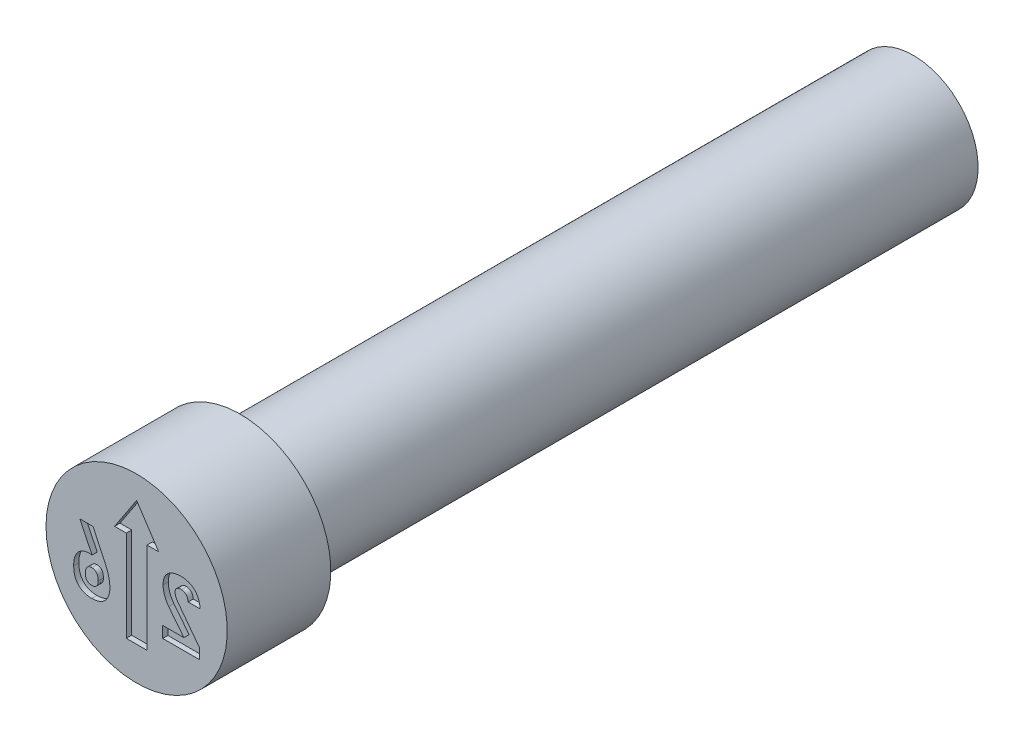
ISO-10303-21;
HEADER;
FILE_DESCRIPTION(('STEP AP214'),'2;1');
FILE_NAME('part.step','',(''),(''),'','','');
FILE_SCHEMA(('AUTOMOTIVE_DESIGN { 1 0 10303 214 1 1 1 1 }'));
ENDSEC;
DATA;
#1=APPLICATION_CONTEXT('core data for automotive mechanical design processes');
#2=APPLICATION_PROTOCOL_DEFINITION('international standard','automotive_design',2000,#1);
#3=PRODUCT_CONTEXT('',#1,'mechanical');
#4=PRODUCT('Part','Part','',(#3));
#5=PRODUCT_RELATED_PRODUCT_CATEGORY('part','',(#4));
#6=PRODUCT_DEFINITION_FORMATION('','',#4);
#7=PRODUCT_DEFINITION_CONTEXT('part definition',#1,'design');
#8=PRODUCT_DEFINITION('design','',#6,#7);
#9=PRODUCT_DEFINITION_SHAPE('','',#8);
#10=(LENGTH_UNIT() NAMED_UNIT(*) SI_UNIT(.MILLI.,.METRE.));
#11=(NAMED_UNIT(*) PLANE_ANGLE_UNIT() SI_UNIT($,.RADIAN.));
#12=(NAMED_UNIT(*) SI_UNIT($,.STERADIAN.) SOLID_ANGLE_UNIT());
#13=UNCERTAINTY_MEASURE_WITH_UNIT(LENGTH_MEASURE(1.E-05),#10,'distance_accuracy_value','');
#14=(GEOMETRIC_REPRESENTATION_CONTEXT(3) GLOBAL_UNCERTAINTY_ASSIGNED_CONTEXT((#13)) GLOBAL_UNIT_ASSIGNED_CONTEXT((#10,
#11,#12)) REPRESENTATION_CONTEXT('',''));
#15=CARTESIAN_POINT('',(0.,0.,0.));
#16=DIRECTION('',(0.,0.,1.));
#17=DIRECTION('',(1.,0.,0.));
#18=AXIS2_PLACEMENT_3D('',#15,#16,#17);
#19=CARTESIAN_POINT('',(0.87499825,0.,0.));
#20=DIRECTION('',(0.,0.,1.));
#21=DIRECTION('',(1.,0.,0.));
#22=AXIS2_PLACEMENT_3D('',#19,#20,#21);
#23=PLANE('',#22);
#24=CARTESIAN_POINT('',(-1.21588961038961,-0.395698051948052,0.));
#25=CARTESIAN_POINT('',(-1.21562771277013,-0.409915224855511,0.));
#26=CARTESIAN_POINT('',(-1.21511607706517,-0.437689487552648,0.));
#27=CARTESIAN_POINT('',(-1.21060303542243,-0.478055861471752,0.));
#28=CARTESIAN_POINT('',(-1.20368809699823,-0.51605184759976,0.));
#29=CARTESIAN_POINT('',(-1.1937049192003,-0.551537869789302,0.));
#30=CARTESIAN_POINT('',(-1.18079119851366,-0.584602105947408,0.));
#31=CARTESIAN_POINT('',(-1.16492689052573,-0.615255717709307,0.));
#32=CARTESIAN_POINT('',(-1.14603900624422,-0.643347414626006,0.));
#33=CARTESIAN_POINT('',(-1.12466471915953,-0.669080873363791,0.));
#34=CARTESIAN_POINT('',(-1.10040634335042,-0.691725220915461,0.));
#35=CARTESIAN_POINT('',(-1.0739145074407,-0.711622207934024,0.));
#36=CARTESIAN_POINT('',(-1.04509598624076,-0.728622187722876,0.));
#37=CARTESIAN_POINT('',(-1.0135241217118,-0.741846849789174,0.));
#38=CARTESIAN_POINT('',(-0.979921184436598,-0.752702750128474,0.));
#39=CARTESIAN_POINT('',(-0.943824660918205,-0.760076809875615,0.));
#40=CARTESIAN_POINT('',(-0.9055486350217,-0.764870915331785,0.));
#41=CARTESIAN_POINT('',(-0.87921661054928,-0.765342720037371,0.));
#42=CARTESIAN_POINT('',(-0.865727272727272,-0.765584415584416,0.));
#43=B_SPLINE_CURVE_WITH_KNOTS('',3,(#24,#25,#26,#27,#28,#29,#30,#31,#32,#33,#34,#35,#36,#37,#38,
#39,#40,#41,#42),.UNSPECIFIED.,.F.,.F.,(4,1,1,1,1,1,1,1,1,1,1,1,1,1,1,1,4),(0.,
0.0736363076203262,0.143853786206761,0.210167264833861,0.273535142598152,0.334525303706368,
0.393774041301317,0.451974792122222,0.509587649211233,0.566708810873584,0.623480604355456,
0.680964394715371,0.739551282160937,0.800463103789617,0.863640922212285,0.930146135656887,1.),.UNSPECIFIED.);
#44=CARTESIAN_POINT('',(-1.21588961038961,-0.395698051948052,0.));
#45=VERTEX_POINT('',#44);
#46=CARTESIAN_POINT('',(-0.865727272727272,-0.765584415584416,0.));
#47=VERTEX_POINT('',#46);
#48=EDGE_CURVE('E54',#45,#47,#43,.T.);
#49=ORIENTED_EDGE('',*,*,#48,.F.);
#50=DIRECTION('',(0.,-1.,0.));
#51=VECTOR('',#50,1.);
#52=CARTESIAN_POINT('',(-1.21588961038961,-0.394724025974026,0.));
#53=LINE('',#52,#51);
#54=CARTESIAN_POINT('',(-1.21588961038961,-0.394724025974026,0.));
#55=VERTEX_POINT('',#54);
#56=EDGE_CURVE('E425',#55,#45,#53,.T.);
#57=ORIENTED_EDGE('',*,*,#56,.F.);
#58=CARTESIAN_POINT('',(-0.904444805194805,-0.0331168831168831,0.));
#59=CARTESIAN_POINT('',(-0.916469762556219,-0.0333895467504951,0.));
#60=CARTESIAN_POINT('',(-0.939873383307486,-0.0339202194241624,0.));
#61=CARTESIAN_POINT('',(-0.97392762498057,-0.0382619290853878,0.));
#62=CARTESIAN_POINT('',(-1.00575387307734,-0.0459559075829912,0.));
#63=CARTESIAN_POINT('',(-1.03575276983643,-0.0560558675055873,0.));
#64=CARTESIAN_POINT('',(-1.06360936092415,-0.0695240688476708,0.));
#65=CARTESIAN_POINT('',(-1.08939273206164,-0.086003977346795,0.));
#66=CARTESIAN_POINT('',(-1.11316297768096,-0.105298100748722,0.));
#67=CARTESIAN_POINT('',(-1.13460681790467,-0.127638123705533,0.));
#68=CARTESIAN_POINT('',(-1.15392534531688,-0.152454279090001,0.));
#69=CARTESIAN_POINT('',(-1.17048053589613,-0.179997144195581,0.));
#70=CARTESIAN_POINT('',(-1.18470759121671,-0.209806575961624,0.));
#71=CARTESIAN_POINT('',(-1.19604188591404,-0.24218065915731,0.));
#72=CARTESIAN_POINT('',(-1.20512581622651,-0.276856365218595,0.));
#73=CARTESIAN_POINT('',(-1.21125947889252,-0.314030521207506,0.));
#74=CARTESIAN_POINT('',(-1.2153159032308,-0.353562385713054,0.));
#75=CARTESIAN_POINT('',(-1.21569487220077,-0.380752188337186,0.));
#76=CARTESIAN_POINT('',(-1.21588961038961,-0.394724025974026,0.));
#77=B_SPLINE_CURVE_WITH_KNOTS('',3,(#58,#59,#60,#61,#62,#63,#64,#65,#66,#67,#68,#69,#70,#71,#72,
#73,#74,#75,#76),.UNSPECIFIED.,.F.,.F.,(4,1,1,1,1,1,1,1,1,1,1,1,1,1,1,1,4),(0.,
0.0665766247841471,0.12957501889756,0.18964484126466,0.247639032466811,0.304530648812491,
0.36051483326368,0.416743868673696,0.473642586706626,0.531631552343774,0.590524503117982,
0.65124161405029,0.714220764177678,0.780176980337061,0.849489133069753,0.922658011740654,1.),.UNSPECIFIED.);
#78=CARTESIAN_POINT('',(-0.904444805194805,-0.0331168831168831,0.));
#79=VERTEX_POINT('',#78);
#80=EDGE_CURVE('E417',#79,#55,#77,.T.);
#81=ORIENTED_EDGE('',*,*,#80,.F.);
#82=CARTESIAN_POINT('',(-0.752253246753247,-0.114935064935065,0.));
#83=CARTESIAN_POINT('',(-0.755942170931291,-0.108382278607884,0.));
#84=CARTESIAN_POINT('',(-0.763171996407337,-0.0955396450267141,0.));
#85=CARTESIAN_POINT('',(-0.777413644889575,-0.0789183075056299,0.));
#86=CARTESIAN_POINT('',(-0.793297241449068,-0.0644841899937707,0.));
#87=CARTESIAN_POINT('',(-0.811666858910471,-0.0530036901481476,0.));
#88=CARTESIAN_POINT('',(-0.831977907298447,-0.0439208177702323,0.));
#89=CARTESIAN_POINT('',(-0.854396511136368,-0.0377286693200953,0.));
#90=CARTESIAN_POINT('',(-0.87872890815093,-0.0336662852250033,0.));
#91=CARTESIAN_POINT('',(-0.895660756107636,-0.033304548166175,0.));
#92=CARTESIAN_POINT('',(-0.904444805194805,-0.0331168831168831,0.));
#93=B_SPLINE_CURVE_WITH_KNOTS('',3,(#82,#83,#84,#85,#86,#87,#88,#89,#90,#91,#92),.UNSPECIFIED.,
.F.,.F.,(4,1,1,1,1,1,1,1,4),(0.,0.123274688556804,0.241602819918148,0.357777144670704,
0.47468395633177,0.595870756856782,0.722082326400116,0.855819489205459,1.),.UNSPECIFIED.);
#94=CARTESIAN_POINT('',(-0.861160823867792,-0.0367677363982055,0.));
#95=VERTEX_POINT('',#94);
#96=EDGE_CURVE('E412',#95,#79,#93,.T.);
#97=ORIENTED_EDGE('',*,*,#96,.F.);
#98=DIRECTION('',(0.435377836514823,-0.900247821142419,0.));
#99=VECTOR('',#98,1.);
#100=CARTESIAN_POINT('',(-1.09657142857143,0.45,0.));
#101=LINE('',#100,#99);
#102=CARTESIAN_POINT('',(-1.09657142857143,0.45,0.));
#103=VERTEX_POINT('',#102);
#104=EDGE_CURVE('E409',#103,#95,#101,.T.);
#105=ORIENTED_EDGE('',*,*,#104,.F.);
#106=DIRECTION('',(-1.,0.,0.));
#107=VECTOR('',#106,1.);
#108=CARTESIAN_POINT('',(-0.841863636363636,0.45,0.));
#109=LINE('',#108,#107);
#110=CARTESIAN_POINT('',(-0.841863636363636,0.45,0.));
#111=VERTEX_POINT('',#110);
#112=EDGE_CURVE('E406',#111,#103,#109,.T.);
#113=ORIENTED_EDGE('',*,*,#112,.F.);
#114=DIRECTION('',(-0.424073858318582,0.905627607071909,0.));
#115=VECTOR('',#114,1.);
#116=CARTESIAN_POINT('',(-0.599331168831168,-0.0679383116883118,0.));
#117=LINE('',#116,#115);
#118=CARTESIAN_POINT('',(-0.599331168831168,-0.0679383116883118,0.));
#119=VERTEX_POINT('',#118);
#120=EDGE_CURVE('E400',#119,#111,#117,.T.);
#121=ORIENTED_EDGE('',*,*,#120,.F.);
#122=CARTESIAN_POINT('',(-0.51653896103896,-0.401542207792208,0.));
#123=CARTESIAN_POINT('',(-0.516846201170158,-0.388382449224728,0.));
#124=CARTESIAN_POINT('',(-0.517471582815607,-0.361596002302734,0.));
#125=CARTESIAN_POINT('',(-0.521833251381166,-0.320940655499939,0.));
#126=CARTESIAN_POINT('',(-0.528572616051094,-0.279197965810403,0.));
#127=CARTESIAN_POINT('',(-0.53845801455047,-0.236741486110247,0.));
#128=CARTESIAN_POINT('',(-0.550511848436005,-0.194005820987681,0.));
#129=CARTESIAN_POINT('',(-0.564791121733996,-0.151483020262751,0.));
#130=CARTESIAN_POINT('',(-0.580668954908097,-0.109273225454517,0.));
#131=CARTESIAN_POINT('',(-0.593093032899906,-0.0817551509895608,0.));
#132=CARTESIAN_POINT('',(-0.599331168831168,-0.0679383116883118,0.));
#133=B_SPLINE_CURVE_WITH_KNOTS('',3,(#122,#123,#124,#125,#126,#127,#128,#129,#130,#131,#132),
.UNSPECIFIED.,.F.,.F.,(4,1,1,1,1,1,1,1,4),(0.,0.114002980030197,0.232050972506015,
0.353906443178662,0.480147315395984,0.609491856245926,0.738474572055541,0.86868794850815,1.),.UNSPECIFIED.);
#134=CARTESIAN_POINT('',(-0.51653896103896,-0.401542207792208,0.));
#135=VERTEX_POINT('',#134);
#136=EDGE_CURVE('E395',#135,#119,#133,.T.);
#137=ORIENTED_EDGE('',*,*,#136,.F.);
#138=DIRECTION('',(0.,1.,0.));
#139=VECTOR('',#138,1.);
#140=CARTESIAN_POINT('',(-0.51653896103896,-0.402272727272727,0.));
#141=LINE('',#140,#139);
#142=CARTESIAN_POINT('',(-0.51653896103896,-0.402272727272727,0.));
#143=VERTEX_POINT('',#142);
#144=EDGE_CURVE('E389',#143,#135,#141,.T.);
#145=ORIENTED_EDGE('',*,*,#144,.F.);
#146=CARTESIAN_POINT('',(-0.865727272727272,-0.765584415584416,0.));
#147=CARTESIAN_POINT('',(-0.852241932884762,-0.765313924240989,0.));
#148=CARTESIAN_POINT('',(-0.826007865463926,-0.764787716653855,0.));
#149=CARTESIAN_POINT('',(-0.787844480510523,-0.760424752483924,0.));
#150=CARTESIAN_POINT('',(-0.752071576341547,-0.75284651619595,0.));
#151=CARTESIAN_POINT('',(-0.718532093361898,-0.742388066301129,0.));
#152=CARTESIAN_POINT('',(-0.68722484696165,-0.729019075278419,0.));
#153=CARTESIAN_POINT('',(-0.658288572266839,-0.71262883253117,0.));
#154=CARTESIAN_POINT('',(-0.631708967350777,-0.693205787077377,0.));
#155=CARTESIAN_POINT('',(-0.607620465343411,-0.670791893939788,0.));
#156=CARTESIAN_POINT('',(-0.586192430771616,-0.64566674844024,0.));
#157=CARTESIAN_POINT('',(-0.567475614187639,-0.618075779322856,0.));
#158=CARTESIAN_POINT('',(-0.551627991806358,-0.588027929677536,0.));
#159=CARTESIAN_POINT('',(-0.538774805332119,-0.555507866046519,0.));
#160=CARTESIAN_POINT('',(-0.528693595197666,-0.520615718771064,0.));
#161=CARTESIAN_POINT('',(-0.521875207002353,-0.483327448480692,0.));
#162=CARTESIAN_POINT('',(-0.517283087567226,-0.443620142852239,0.));
#163=CARTESIAN_POINT('',(-0.51679192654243,-0.41632876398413,0.));
#164=CARTESIAN_POINT('',(-0.51653896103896,-0.402272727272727,0.));
#165=B_SPLINE_CURVE_WITH_KNOTS('',3,(#146,#147,#148,#149,#150,#151,#152,#153,#154,#155,#156,
#157,#158,#159,#160,#161,#162,#163,#164),.UNSPECIFIED.,.F.,.F.,(4,1,1,1,1,1,1,1,1,1,1,1,1,1,1,1,
4),(0.,0.0706034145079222,0.137350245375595,0.200790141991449,0.261822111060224,
0.321037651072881,0.378713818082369,0.435588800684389,0.493032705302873,0.550614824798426,
0.60814515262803,0.667276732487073,0.728130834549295,0.790952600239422,0.85714223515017,
0.926423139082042,1.),.UNSPECIFIED.);
#166=EDGE_CURVE('E381',#47,#143,#165,.T.);
#167=ORIENTED_EDGE('',*,*,#166,.F.);
#168=EDGE_LOOP('',(#49,#57,#81,#97,#105,#113,#121,#137,#145,#167));
#169=FACE_BOUND('',#168,.T.);
#170=DIRECTION('',(1.,0.,0.));
#171=VECTOR('',#170,1.);
#172=CARTESIAN_POINT('',(0.504464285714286,-0.75,0.));
#173=LINE('',#172,#171);
#174=CARTESIAN_POINT('',(0.504464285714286,-0.75,0.));
#175=VERTEX_POINT('',#174);
#176=CARTESIAN_POINT('',(1.21112012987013,-0.75,0.));
#177=VERTEX_POINT('',#176);
#178=EDGE_CURVE('E434',#175,#177,#173,.T.);
#179=ORIENTED_EDGE('',*,*,#178,.F.);
#180=DIRECTION('',(0.,-1.,0.));
#181=VECTOR('',#180,1.);
#182=CARTESIAN_POINT('',(0.504464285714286,-0.531818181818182,0.));
#183=LINE('',#182,#181);
#184=CARTESIAN_POINT('',(0.504464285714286,-0.531818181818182,0.));
#185=VERTEX_POINT('',#184);
#186=EDGE_CURVE('E456',#185,#175,#183,.T.);
#187=ORIENTED_EDGE('',*,*,#186,.F.);
#188=DIRECTION('',(-1.,0.,0.));
#189=VECTOR('',#188,1.);
#190=CARTESIAN_POINT('',(0.912824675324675,-0.531818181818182,0.));
#191=LINE('',#190,#189);
#192=CARTESIAN_POINT('',(0.912824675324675,-0.531818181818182,0.));
#193=VERTEX_POINT('',#192);
#194=EDGE_CURVE('E673',#193,#185,#191,.T.);
#195=ORIENTED_EDGE('',*,*,#194,.F.);
#196=DIRECTION('',(0.618183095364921,-0.786034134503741,0.));
#197=VECTOR('',#196,1.);
#198=CARTESIAN_POINT('',(0.618668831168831,-0.157792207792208,0.));
#199=LINE('',#198,#197);
#200=CARTESIAN_POINT('',(0.618668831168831,-0.157792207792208,0.));
#201=VERTEX_POINT('',#200);
#202=EDGE_CURVE('E676',#201,#193,#199,.T.);
#203=ORIENTED_EDGE('',*,*,#202,.F.);
#204=CARTESIAN_POINT('',(0.511038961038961,0.150974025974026,0.));
#205=CARTESIAN_POINT('',(0.511349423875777,0.137320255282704,0.));
#206=CARTESIAN_POINT('',(0.511970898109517,0.10998858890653,0.));
#207=CARTESIAN_POINT('',(0.5175807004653,0.0690829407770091,0.));
#208=CARTESIAN_POINT('',(0.52662078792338,0.0283861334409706,0.));
#209=CARTESIAN_POINT('',(0.539036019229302,-0.0119052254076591,0.));
#210=CARTESIAN_POINT('',(0.554458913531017,-0.0510932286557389,0.));
#211=CARTESIAN_POINT('',(0.572969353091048,-0.0886411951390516,0.));
#212=CARTESIAN_POINT('',(0.593860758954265,-0.124565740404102,0.));
#213=CARTESIAN_POINT('',(0.610415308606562,-0.146737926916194,0.));
#214=CARTESIAN_POINT('',(0.618668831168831,-0.157792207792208,0.));
#215=B_SPLINE_CURVE_WITH_KNOTS('',3,(#204,#205,#206,#207,#208,#209,#210,#211,#212,#213,#214),
.UNSPECIFIED.,.F.,.F.,(4,1,1,1,1,1,1,1,4),(0.,0.123046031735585,0.246309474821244,
0.371480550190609,0.498560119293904,0.626024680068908,0.750715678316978,0.875715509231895,1.),.UNSPECIFIED.);
#216=CARTESIAN_POINT('',(0.511038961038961,0.150974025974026,0.));
#217=VERTEX_POINT('',#216);
#218=EDGE_CURVE('E679',#217,#201,#215,.T.);
#219=ORIENTED_EDGE('',*,*,#218,.F.);
#220=DIRECTION('',(0.,-1.,0.));
#221=VECTOR('',#220,1.);
#222=CARTESIAN_POINT('',(0.511038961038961,0.151948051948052,0.));
#223=LINE('',#222,#221);
#224=CARTESIAN_POINT('',(0.511038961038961,0.151948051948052,0.));
#225=VERTEX_POINT('',#224);
#226=EDGE_CURVE('E684',#225,#217,#223,.T.);
#227=ORIENTED_EDGE('',*,*,#226,.F.);
#228=CARTESIAN_POINT('',(0.864366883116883,0.465584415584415,0.));
#229=CARTESIAN_POINT('',(0.850719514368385,0.465390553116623,0.));
#230=CARTESIAN_POINT('',(0.824177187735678,0.465013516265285,0.));
#231=CARTESIAN_POINT('',(0.785536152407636,0.460943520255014,0.));
#232=CARTESIAN_POINT('',(0.749179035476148,0.454800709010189,0.));
#233=CARTESIAN_POINT('',(0.715164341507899,0.445814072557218,0.));
#234=CARTESIAN_POINT('',(0.683628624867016,0.434091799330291,0.));
#235=CARTESIAN_POINT('',(0.654477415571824,0.419957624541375,0.));
#236=CARTESIAN_POINT('',(0.62764977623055,0.403291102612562,0.));
#237=CARTESIAN_POINT('',(0.603351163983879,0.38405660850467,0.));
#238=CARTESIAN_POINT('',(0.581488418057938,0.362603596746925,0.));
#239=CARTESIAN_POINT('',(0.562670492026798,0.338714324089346,0.));
#240=CARTESIAN_POINT('',(0.54638045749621,0.312871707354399,0.));
#241=CARTESIAN_POINT('',(0.533646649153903,0.2845745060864,0.));
#242=CARTESIAN_POINT('',(0.523163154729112,0.254488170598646,0.));
#243=CARTESIAN_POINT('',(0.516375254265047,0.222073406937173,0.));
#244=CARTESIAN_POINT('',(0.51180107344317,0.187711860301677,0.));
#245=CARTESIAN_POINT('',(0.511297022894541,0.164058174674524,0.));
#246=CARTESIAN_POINT('',(0.511038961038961,0.151948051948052,0.));
#247=B_SPLINE_CURVE_WITH_KNOTS('',3,(#228,#229,#230,#231,#232,#233,#234,#235,#236,#237,#238,
#239,#240,#241,#242,#243,#244,#245,#246),.UNSPECIFIED.,.F.,.F.,(4,1,1,1,1,1,1,1,1,1,1,1,1,1,1,1,
4),(0.,0.0762312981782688,0.148259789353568,0.216860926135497,0.28210063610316,
0.344528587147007,0.404571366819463,0.462840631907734,0.520642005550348,0.577409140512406,
0.633580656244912,0.690215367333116,0.747647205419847,0.806597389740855,0.867894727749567,
0.932365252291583,1.),.UNSPECIFIED.);
#248=CARTESIAN_POINT('',(0.864366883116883,0.465584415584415,0.));
#249=VERTEX_POINT('',#248);
#250=EDGE_CURVE('E690',#249,#225,#247,.T.);
#251=ORIENTED_EDGE('',*,*,#250,.F.);
#252=CARTESIAN_POINT('',(1.22597402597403,0.105438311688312,0.));
#253=CARTESIAN_POINT('',(1.22483495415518,0.11934799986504,0.));
#254=CARTESIAN_POINT('',(1.2226115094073,0.146499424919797,0.));
#255=CARTESIAN_POINT('',(1.21532209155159,0.185775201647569,0.));
#256=CARTESIAN_POINT('',(1.20590080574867,0.22277029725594,0.));
#257=CARTESIAN_POINT('',(1.19391566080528,0.257477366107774,0.));
#258=CARTESIAN_POINT('',(1.17851470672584,0.289494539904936,0.));
#259=CARTESIAN_POINT('',(1.16121126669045,0.3194911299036,0.));
#260=CARTESIAN_POINT('',(1.14039956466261,0.346539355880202,0.));
#261=CARTESIAN_POINT('',(1.11761824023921,0.371544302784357,0.));
#262=CARTESIAN_POINT('',(1.09224391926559,0.393568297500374,0.));
#263=CARTESIAN_POINT('',(1.06518792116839,0.412996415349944,0.));
#264=CARTESIAN_POINT('',(1.03604111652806,0.429163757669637,0.));
#265=CARTESIAN_POINT('',(1.00524661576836,0.442575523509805,0.));
#266=CARTESIAN_POINT('',(0.972462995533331,0.452754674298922,0.));
#267=CARTESIAN_POINT('',(0.938118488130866,0.460379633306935,0.));
#268=CARTESIAN_POINT('',(0.90181888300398,0.464776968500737,0.));
#269=CARTESIAN_POINT('',(0.877040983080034,0.465311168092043,0.));
#270=CARTESIAN_POINT('',(0.864366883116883,0.465584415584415,0.));
#271=B_SPLINE_CURVE_WITH_KNOTS('',3,(#252,#253,#254,#255,#256,#257,#258,#259,#260,#261,#262,
#263,#264,#265,#266,#267,#268,#269,#270),.UNSPECIFIED.,.F.,.F.,(4,1,1,1,1,1,1,1,1,1,1,1,1,1,1,1,
4),(0.,0.0733268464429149,0.14313249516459,0.209679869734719,0.273918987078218,0.33576228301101,
0.396210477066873,0.45560885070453,0.514796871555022,0.573764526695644,0.631900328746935,
0.689592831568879,0.748648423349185,0.808163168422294,0.86976604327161,0.933384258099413,1.),.UNSPECIFIED.);
#272=CARTESIAN_POINT('',(1.22597402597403,0.105438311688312,0.));
#273=VERTEX_POINT('',#272);
#274=EDGE_CURVE('E695',#273,#249,#271,.T.);
#275=ORIENTED_EDGE('',*,*,#274,.F.);
#276=DIRECTION('',(0.,1.,0.));
#277=VECTOR('',#276,1.);
#278=CARTESIAN_POINT('',(1.22597402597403,0.104707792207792,0.));
#279=LINE('',#278,#277);
#280=CARTESIAN_POINT('',(1.22597402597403,0.104707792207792,0.));
#281=VERTEX_POINT('',#280);
#282=EDGE_CURVE('E703',#281,#273,#279,.T.);
#283=ORIENTED_EDGE('',*,*,#282,.F.);
#284=DIRECTION('',(1.,0.,0.));
#285=VECTOR('',#284,1.);
#286=CARTESIAN_POINT('',(0.99512987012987,0.104707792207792,0.));
#287=LINE('',#286,#285);
#288=CARTESIAN_POINT('',(0.99512987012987,0.104707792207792,0.));
#289=VERTEX_POINT('',#288);
#290=EDGE_CURVE('E709',#289,#281,#287,.T.);
#291=ORIENTED_EDGE('',*,*,#290,.F.);
#292=DIRECTION('',(0.,-1.,0.));
#293=VECTOR('',#292,1.);
#294=CARTESIAN_POINT('',(0.99512987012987,0.105438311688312,0.));
#295=LINE('',#294,#293);
#296=CARTESIAN_POINT('',(0.99512987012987,0.105438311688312,0.));
#297=VERTEX_POINT('',#296);
#298=EDGE_CURVE('E712',#297,#289,#295,.T.);
#299=ORIENTED_EDGE('',*,*,#298,.F.);
#300=CARTESIAN_POINT('',(0.862662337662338,0.247402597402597,0.));
#301=CARTESIAN_POINT('',(0.871484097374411,0.247058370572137,0.));
#302=CARTESIAN_POINT('',(0.888625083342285,0.246389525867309,0.));
#303=CARTESIAN_POINT('',(0.912891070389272,0.238976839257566,0.));
#304=CARTESIAN_POINT('',(0.934757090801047,0.227349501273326,0.));
#305=CARTESIAN_POINT('',(0.953607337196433,0.210758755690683,0.));
#306=CARTESIAN_POINT('',(0.9692167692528,0.189928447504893,0.));
#307=CARTESIAN_POINT('',(0.981885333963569,0.165399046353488,0.));
#308=CARTESIAN_POINT('',(0.990489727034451,0.136727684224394,0.));
#309=CARTESIAN_POINT('',(0.993533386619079,0.116203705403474,0.));
#310=CARTESIAN_POINT('',(0.99512987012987,0.105438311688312,0.));
#311=B_SPLINE_CURVE_WITH_KNOTS('',3,(#300,#301,#302,#303,#304,#305,#306,#307,#308,#309,#310),
.UNSPECIFIED.,.F.,.F.,(4,1,1,1,1,1,1,1,4),(0.,0.122603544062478,0.238222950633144,
0.350089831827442,0.465559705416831,0.58502806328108,0.711014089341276,0.848418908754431,1.),.UNSPECIFIED.);
#312=CARTESIAN_POINT('',(0.862662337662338,0.247402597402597,0.));
#313=VERTEX_POINT('',#312);
#314=EDGE_CURVE('E715',#313,#297,#311,.T.);
#315=ORIENTED_EDGE('',*,*,#314,.F.);
#316=CARTESIAN_POINT('',(0.742857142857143,0.145616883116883,0.));
#317=CARTESIAN_POINT('',(0.743189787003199,0.153289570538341,0.));
#318=CARTESIAN_POINT('',(0.743827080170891,0.16798921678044,0.));
#319=CARTESIAN_POINT('',(0.749831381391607,0.188701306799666,0.));
#320=CARTESIAN_POINT('',(0.759672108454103,0.206738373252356,0.));
#321=CARTESIAN_POINT('',(0.773766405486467,0.221636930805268,0.));
#322=CARTESIAN_POINT('',(0.791312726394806,0.23342079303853,0.));
#323=CARTESIAN_POINT('',(0.812307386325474,0.241725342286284,0.));
#324=CARTESIAN_POINT('',(0.836475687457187,0.246487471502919,0.));
#325=CARTESIAN_POINT('',(0.853630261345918,0.247086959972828,0.));
#326=CARTESIAN_POINT('',(0.862662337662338,0.247402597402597,0.));
#327=B_SPLINE_CURVE_WITH_KNOTS('',3,(#316,#317,#318,#319,#320,#321,#322,#323,#324,#325,#326),
.UNSPECIFIED.,.F.,.F.,(4,1,1,1,1,1,1,1,4),(0.,0.128749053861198,0.246662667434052,
0.359069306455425,0.47107757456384,0.588039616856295,0.711712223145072,0.848213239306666,1.),.UNSPECIFIED.);
#328=CARTESIAN_POINT('',(0.742857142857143,0.145616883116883,0.));
#329=VERTEX_POINT('',#328);
#330=EDGE_CURVE('E720',#329,#313,#327,.T.);
#331=ORIENTED_EDGE('',*,*,#330,.F.);
#332=DIRECTION('',(0.,1.,0.));
#333=VECTOR('',#332,1.);
#334=CARTESIAN_POINT('',(0.742857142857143,0.143912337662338,0.));
#335=LINE('',#334,#333);
#336=CARTESIAN_POINT('',(0.742857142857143,0.143912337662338,0.));
#337=VERTEX_POINT('',#336);
#338=EDGE_CURVE('E728',#337,#329,#335,.T.);
#339=ORIENTED_EDGE('',*,*,#338,.F.);
#340=CARTESIAN_POINT('',(0.801055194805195,-0.00267857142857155,0.));
#341=CARTESIAN_POINT('',(0.792466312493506,0.00942362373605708,0.));
#342=CARTESIAN_POINT('',(0.775731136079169,0.0330043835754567,0.));
#343=CARTESIAN_POINT('',(0.760584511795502,0.065387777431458,0.));
#344=CARTESIAN_POINT('',(0.751148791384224,0.0907767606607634,0.));
#345=CARTESIAN_POINT('',(0.746651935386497,0.109188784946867,0.));
#346=CARTESIAN_POINT('',(0.743444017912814,0.126755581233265,0.));
#347=CARTESIAN_POINT('',(0.74304917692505,0.138298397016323,0.));
#348=CARTESIAN_POINT('',(0.742857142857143,0.143912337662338,0.));
#349=B_SPLINE_CURVE_WITH_KNOTS('',3,(#340,#341,#342,#343,#344,#345,#346,#347,#348),
.UNSPECIFIED.,.F.,.F.,(4,1,1,1,1,1,4),(0.,0.27737542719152,0.54045759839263,0.666416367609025,
0.784009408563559,0.894951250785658,1.),.UNSPECIFIED.);
#350=CARTESIAN_POINT('',(0.801055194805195,-0.00267857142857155,0.));
#351=VERTEX_POINT('',#350);
#352=EDGE_CURVE('E734',#351,#337,#349,.T.);
#353=ORIENTED_EDGE('',*,*,#352,.F.);
#354=DIRECTION('',(-0.602458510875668,0.798150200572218,0.));
#355=VECTOR('',#354,1.);
#356=CARTESIAN_POINT('',(1.21112012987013,-0.545941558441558,0.));
#357=LINE('',#356,#355);
#358=CARTESIAN_POINT('',(1.21112012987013,-0.545941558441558,0.));
#359=VERTEX_POINT('',#358);
#360=EDGE_CURVE('E739',#359,#351,#357,.T.);
#361=ORIENTED_EDGE('',*,*,#360,.F.);
#362=DIRECTION('',(0.,1.,0.));
#363=VECTOR('',#362,1.);
#364=CARTESIAN_POINT('',(1.21112012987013,-0.75,0.));
#365=LINE('',#364,#363);
#366=EDGE_CURVE('E745',#177,#359,#365,.T.);
#367=ORIENTED_EDGE('',*,*,#366,.F.);
#368=EDGE_LOOP('',(#179,#187,#195,#203,#219,#227,#251,#275,#283,#291,#299,#315,#331,#339,#353,
#361,#367));
#369=FACE_BOUND('',#368,.T.);
#370=CARTESIAN_POINT('',(0.,0.,0.));
#371=DIRECTION('',(0.,0.,-1.));
#372=DIRECTION('',(-1.,0.,0.));
#373=AXIS2_PLACEMENT_3D('',#370,#371,#372);
#374=CIRCLE('',#373,1.7499965);
#375=CARTESIAN_POINT('',(-1.74999649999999,0.,0.));
#376=VERTEX_POINT('',#375);
#377=EDGE_CURVE('E41',#376,#376,#374,.T.);
#378=ORIENTED_EDGE('',*,*,#377,.F.);
#379=EDGE_LOOP('',(#378));
#380=FACE_BOUND('',#379,.T.);
#381=DIRECTION('',(0.,1.,0.));
#382=VECTOR('',#381,1.);
#383=CARTESIAN_POINT('',(0.2,0.,0.));
#384=LINE('',#383,#382);
#385=CARTESIAN_POINT('',(0.2,0.660419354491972,0.));
#386=VERTEX_POINT('',#385);
#387=CARTESIAN_POINT('',(0.2,-1.1,0.));
#388=VERTEX_POINT('',#387);
#389=EDGE_CURVE('E564',#386,#388,#384,.F.);
#390=ORIENTED_EDGE('',*,*,#389,.T.);
#391=DIRECTION('',(1.,0.,0.));
#392=VECTOR('',#391,1.);
#393=CARTESIAN_POINT('',(0.87499825,-1.1,0.));
#394=LINE('',#393,#392);
#395=CARTESIAN_POINT('',(-0.2,-1.1,0.));
#396=VERTEX_POINT('',#395);
#397=EDGE_CURVE('E567',#388,#396,#394,.F.);
#398=ORIENTED_EDGE('',*,*,#397,.T.);
#399=DIRECTION('',(0.,1.,0.));
#400=VECTOR('',#399,1.);
#401=CARTESIAN_POINT('',(-0.2,0.,0.));
#402=LINE('',#401,#400);
#403=CARTESIAN_POINT('',(-0.2,0.660419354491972,0.));
#404=VERTEX_POINT('',#403);
#405=EDGE_CURVE('E585',#396,#404,#402,.T.);
#406=ORIENTED_EDGE('',*,*,#405,.T.);
#407=DIRECTION('',(1.,0.,0.));
#408=VECTOR('',#407,1.);
#409=CARTESIAN_POINT('',(0.87499825,0.660419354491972,0.));
#410=LINE('',#409,#408);
#411=CARTESIAN_POINT('',(-0.425641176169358,0.660419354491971,0.));
#412=VERTEX_POINT('',#411);
#413=EDGE_CURVE('E582',#404,#412,#410,.F.);
#414=ORIENTED_EDGE('',*,*,#413,.T.);
#415=DIRECTION('',(0.550159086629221,0.83505986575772,0.));
#416=VECTOR('',#415,1.);
#417=CARTESIAN_POINT('',(-0.425641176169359,0.660419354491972,0.));
#418=LINE('',#417,#416);
#419=CARTESIAN_POINT('',(0.,1.30647950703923,0.));
#420=VERTEX_POINT('',#419);
#421=EDGE_CURVE('E579',#412,#420,#418,.T.);
#422=ORIENTED_EDGE('',*,*,#421,.T.);
#423=DIRECTION('',(0.550159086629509,-0.83505986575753,0.));
#424=VECTOR('',#423,1.);
#425=CARTESIAN_POINT('',(0.,1.30647950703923,0.));
#426=LINE('',#425,#424);
#427=CARTESIAN_POINT('',(0.425641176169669,0.660419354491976,0.));
#428=VERTEX_POINT('',#427);
#429=EDGE_CURVE('E574',#420,#428,#426,.T.);
#430=ORIENTED_EDGE('',*,*,#429,.T.);
#431=DIRECTION('',(1.,0.,0.));
#432=VECTOR('',#431,1.);
#433=CARTESIAN_POINT('',(0.87499825,0.660419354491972,0.));
#434=LINE('',#433,#432);
#435=EDGE_CURVE('E570',#428,#386,#434,.F.);
#436=ORIENTED_EDGE('',*,*,#435,.T.);
#437=EDGE_LOOP('',(#390,#398,#406,#414,#422,#430,#436));
#438=FACE_BOUND('',#437,.T.);
#439=ADVANCED_FACE('F37',(#169,#369,#380,#438),#23,.T.);
#440=CARTESIAN_POINT('',(-0.2,-1.1,-2.08977062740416));
#441=DIRECTION('',(-1.,0.,0.));
#442=DIRECTION('',(0.,0.,1.));
#443=AXIS2_PLACEMENT_3D('',#440,#441,#442);
#444=PLANE('',#443);
#445=DIRECTION('',(0.,-1.,0.));
#446=VECTOR('',#445,1.);
#447=CARTESIAN_POINT('',(-0.2,0.660419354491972,-0.10447943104));
#448=LINE('',#447,#446);
#449=CARTESIAN_POINT('',(-0.2,0.660419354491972,-0.10447943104));
#450=VERTEX_POINT('',#449);
#451=CARTESIAN_POINT('',(-0.2,-1.1,-0.10447943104));
#452=VERTEX_POINT('',#451);
#453=EDGE_CURVE('E620',#450,#452,#448,.T.);
#454=ORIENTED_EDGE('',*,*,#453,.F.);
#455=DIRECTION('',(0.,0.,1.));
#456=VECTOR('',#455,1.);
#457=CARTESIAN_POINT('',(-0.2,0.660419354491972,-0.14223971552));
#458=LINE('',#457,#456);
#459=EDGE_CURVE('E601',#404,#450,#458,.F.);
#460=ORIENTED_EDGE('',*,*,#459,.F.);
#461=ORIENTED_EDGE('',*,*,#405,.F.);
#462=DIRECTION('',(0.,0.,-1.));
#463=VECTOR('',#462,1.);
#464=CARTESIAN_POINT('',(-0.2,-1.1,-2.08977062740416));
#465=LINE('',#464,#463);
#466=EDGE_CURVE('E587',#396,#452,#465,.T.);
#467=ORIENTED_EDGE('',*,*,#466,.T.);
#468=EDGE_LOOP('',(#454,#460,#461,#467));
#469=FACE_BOUND('',#468,.T.);
#470=ADVANCED_FACE('F39',(#469),#444,.F.);
#471=CARTESIAN_POINT('',(2.771111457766E-13,0.660419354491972,-0.14223971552));
#472=DIRECTION('',(0.,1.,0.));
#473=DIRECTION('',(0.,0.,1.));
#474=AXIS2_PLACEMENT_3D('',#471,#472,#473);
#475=PLANE('',#474);
#476=ORIENTED_EDGE('',*,*,#459,.T.);
#477=DIRECTION('',(1.,0.,0.));
#478=VECTOR('',#477,1.);
#479=CARTESIAN_POINT('',(-0.425641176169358,0.660419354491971,-0.10447943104));
#480=LINE('',#479,#478);
#481=CARTESIAN_POINT('',(-0.425641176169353,0.660419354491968,-0.10447943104));
#482=VERTEX_POINT('',#481);
#483=EDGE_CURVE('E625',#482,#450,#480,.T.);
#484=ORIENTED_EDGE('',*,*,#483,.F.);
#485=DIRECTION('',(0.,0.,1.));
#486=VECTOR('',#485,1.);
#487=CARTESIAN_POINT('',(-0.425641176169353,0.660419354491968,-0.65023869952));
#488=LINE('',#487,#486);
#489=EDGE_CURVE('E599',#482,#412,#488,.T.);
#490=ORIENTED_EDGE('',*,*,#489,.T.);
#491=ORIENTED_EDGE('',*,*,#413,.F.);
#492=EDGE_LOOP('',(#476,#484,#490,#491));
#493=FACE_BOUND('',#492,.T.);
#494=ADVANCED_FACE('F537',(#493),#475,.T.);
#495=CARTESIAN_POINT('',(-0.721917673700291,0.210715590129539,-0.65023869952));
#496=DIRECTION('',(-0.835059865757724,0.550159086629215,0.));
#497=DIRECTION('',(-0.550159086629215,-0.835059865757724,0.));
#498=AXIS2_PLACEMENT_3D('',#495,#496,#497);
#499=PLANE('',#498);
#500=DIRECTION('',(-0.55015908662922,-0.835059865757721,0.));
#501=VECTOR('',#500,1.);
#502=CARTESIAN_POINT('',(0.,1.30647950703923,-0.10447943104));
#503=LINE('',#502,#501);
#504=CARTESIAN_POINT('',(0.,1.30647950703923,-0.10447943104));
#505=VERTEX_POINT('',#504);
#506=EDGE_CURVE('E627',#505,#482,#503,.T.);
#507=ORIENTED_EDGE('',*,*,#506,.F.);
#508=DIRECTION('',(0.,0.,1.));
#509=VECTOR('',#508,1.);
#510=CARTESIAN_POINT('',(0.,1.30647950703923,-0.65023869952));
#511=LINE('',#510,#509);
#512=EDGE_CURVE('E597',#505,#420,#511,.T.);
#513=ORIENTED_EDGE('',*,*,#512,.T.);
#514=ORIENTED_EDGE('',*,*,#421,.F.);
#515=ORIENTED_EDGE('',*,*,#489,.F.);
#516=EDGE_LOOP('',(#507,#513,#514,#515));
#517=FACE_BOUND('',#516,.T.);
#518=ADVANCED_FACE('F534',(#517),#499,.F.);
#519=CARTESIAN_POINT('',(0.,1.30647950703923,-0.65023869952));
#520=DIRECTION('',(0.835059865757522,0.550159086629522,0.));
#521=DIRECTION('',(-0.550159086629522,0.835059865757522,0.));
#522=AXIS2_PLACEMENT_3D('',#519,#520,#521);
#523=PLANE('',#522);
#524=DIRECTION('',(-0.550159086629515,0.835059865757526,0.));
#525=VECTOR('',#524,1.);
#526=CARTESIAN_POINT('',(0.425641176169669,0.660419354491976,-0.10447943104));
#527=LINE('',#526,#525);
#528=CARTESIAN_POINT('',(0.425641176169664,0.660419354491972,-0.10447943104));
#529=VERTEX_POINT('',#528);
#530=EDGE_CURVE('E630',#529,#505,#527,.T.);
#531=ORIENTED_EDGE('',*,*,#530,.F.);
#532=DIRECTION('',(0.,0.,1.));
#533=VECTOR('',#532,1.);
#534=CARTESIAN_POINT('',(0.425641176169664,0.660419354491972,-0.14223971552));
#535=LINE('',#534,#533);
#536=EDGE_CURVE('E594',#428,#529,#535,.F.);
#537=ORIENTED_EDGE('',*,*,#536,.F.);
#538=ORIENTED_EDGE('',*,*,#429,.F.);
#539=ORIENTED_EDGE('',*,*,#512,.F.);
#540=EDGE_LOOP('',(#531,#537,#538,#539));
#541=FACE_BOUND('',#540,.T.);
#542=ADVANCED_FACE('F530',(#541),#523,.F.);
#543=CARTESIAN_POINT('',(2.771111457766E-13,0.660419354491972,-0.14223971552));
#544=DIRECTION('',(0.,1.,0.));
#545=DIRECTION('',(0.,0.,1.));
#546=AXIS2_PLACEMENT_3D('',#543,#544,#545);
#547=PLANE('',#546);
#548=ORIENTED_EDGE('',*,*,#536,.T.);
#549=DIRECTION('',(1.,0.,0.));
#550=VECTOR('',#549,1.);
#551=CARTESIAN_POINT('',(0.2,0.660419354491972,-0.10447943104));
#552=LINE('',#551,#550);
#553=CARTESIAN_POINT('',(0.2,0.660419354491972,-0.10447943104));
#554=VERTEX_POINT('',#553);
#555=EDGE_CURVE('E633',#554,#529,#552,.T.);
#556=ORIENTED_EDGE('',*,*,#555,.F.);
#557=DIRECTION('',(0.,0.,1.));
#558=VECTOR('',#557,1.);
#559=CARTESIAN_POINT('',(0.2,0.660419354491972,-2.08977062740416));
#560=LINE('',#559,#558);
#561=EDGE_CURVE('E592',#554,#386,#560,.T.);
#562=ORIENTED_EDGE('',*,*,#561,.T.);
#563=ORIENTED_EDGE('',*,*,#435,.F.);
#564=EDGE_LOOP('',(#548,#556,#562,#563));
#565=FACE_BOUND('',#564,.T.);
#566=ADVANCED_FACE('F526',(#565),#547,.T.);
#567=CARTESIAN_POINT('',(0.2,-1.1,-2.08977062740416));
#568=DIRECTION('',(1.,0.,0.));
#569=DIRECTION('',(0.,1.,0.));
#570=AXIS2_PLACEMENT_3D('',#567,#568,#569);
#571=PLANE('',#570);
#572=DIRECTION('',(0.,1.,0.));
#573=VECTOR('',#572,1.);
#574=CARTESIAN_POINT('',(0.2,-1.1,-0.10447943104));
#575=LINE('',#574,#573);
#576=CARTESIAN_POINT('',(0.2,-1.1,-0.10447943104));
#577=VERTEX_POINT('',#576);
#578=EDGE_CURVE('E602',#577,#554,#575,.T.);
#579=ORIENTED_EDGE('',*,*,#578,.F.);
#580=DIRECTION('',(0.,0.,-1.));
#581=VECTOR('',#580,1.);
#582=CARTESIAN_POINT('',(0.2,-1.1,-2.08977062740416));
#583=LINE('',#582,#581);
#584=EDGE_CURVE('E590',#577,#388,#583,.F.);
#585=ORIENTED_EDGE('',*,*,#584,.T.);
#586=ORIENTED_EDGE('',*,*,#389,.F.);
#587=ORIENTED_EDGE('',*,*,#561,.F.);
#588=EDGE_LOOP('',(#579,#585,#586,#587));
#589=FACE_BOUND('',#588,.T.);
#590=ADVANCED_FACE('F522',(#589),#571,.F.);
#591=CARTESIAN_POINT('',(-0.2,-1.1,-2.08977062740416));
#592=DIRECTION('',(0.,-1.,0.));
#593=DIRECTION('',(0.,0.,-1.));
#594=AXIS2_PLACEMENT_3D('',#591,#592,#593);
#595=PLANE('',#594);
#596=DIRECTION('',(1.,0.,0.));
#597=VECTOR('',#596,1.);
#598=CARTESIAN_POINT('',(-0.2,-1.1,-0.10447943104));
#599=LINE('',#598,#597);
#600=EDGE_CURVE('E616',#452,#577,#599,.T.);
#601=ORIENTED_EDGE('',*,*,#600,.F.);
#602=ORIENTED_EDGE('',*,*,#466,.F.);
#603=ORIENTED_EDGE('',*,*,#397,.F.);
#604=ORIENTED_EDGE('',*,*,#584,.F.);
#605=EDGE_LOOP('',(#601,#602,#603,#604));
#606=FACE_BOUND('',#605,.T.);
#607=ADVANCED_FACE('F504',(#606),#595,.F.);
#608=CARTESIAN_POINT('',(0.,0.,-0.999998));
#609=DIRECTION('',(0.,0.,-1.));
#610=DIRECTION('',(-1.,0.,0.));
#611=AXIS2_PLACEMENT_3D('',#608,#609,#610);
#612=CYLINDRICAL_SURFACE('',#611,1.7499965);
#613=ORIENTED_EDGE('',*,*,#377,.T.);
#614=EDGE_LOOP('',(#613));
#615=FACE_BOUND('',#614,.T.);
#616=CARTESIAN_POINT('',(0.,0.,-1.999996));
#617=DIRECTION('',(0.,0.,-1.));
#618=DIRECTION('',(-1.,0.,0.));
#619=AXIS2_PLACEMENT_3D('',#616,#617,#618);
#620=CIRCLE('',#619,1.7499965);
#621=CARTESIAN_POINT('',(-1.74999649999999,0.,-1.999996));
#622=VERTEX_POINT('',#621);
#623=EDGE_CURVE('E605',#622,#622,#620,.T.);
#624=ORIENTED_EDGE('',*,*,#623,.F.);
#625=EDGE_LOOP('',(#624));
#626=FACE_BOUND('',#625,.T.);
#627=ADVANCED_FACE('F499',(#615,#626),#612,.T.);
#628=CARTESIAN_POINT('',(0.62499875,0.,-14.99997));
#629=DIRECTION('',(0.,0.,-1.));
#630=DIRECTION('',(-1.,0.,0.));
#631=AXIS2_PLACEMENT_3D('',#628,#629,#630);
#632=PLANE('',#631);
#633=CARTESIAN_POINT('',(0.,0.,-14.99997));
#634=DIRECTION('',(0.,0.,-1.));
#635=DIRECTION('',(-1.,0.,0.));
#636=AXIS2_PLACEMENT_3D('',#633,#634,#635);
#637=CIRCLE('',#636,1.2499975);
#638=CARTESIAN_POINT('',(-1.24999749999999,0.,-14.99997));
#639=VERTEX_POINT('',#638);
#640=EDGE_CURVE('E46',#639,#639,#637,.F.);
#641=ORIENTED_EDGE('',*,*,#640,.F.);
#642=EDGE_LOOP('',(#641));
#643=FACE_BOUND('',#642,.T.);
#644=ADVANCED_FACE('F507',(#643),#632,.T.);
#645=CARTESIAN_POINT('',(1.499997,0.,-1.999996));
#646=DIRECTION('',(0.,0.,-1.));
#647=DIRECTION('',(-1.,0.,0.));
#648=AXIS2_PLACEMENT_3D('',#645,#646,#647);
#649=PLANE('',#648);
#650=CARTESIAN_POINT('',(0.,0.,-1.999996));
#651=DIRECTION('',(0.,0.,-1.));
#652=DIRECTION('',(-1.,0.,0.));
#653=AXIS2_PLACEMENT_3D('',#650,#651,#652);
#654=CIRCLE('',#653,1.2499975);
#655=CARTESIAN_POINT('',(-1.24999749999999,0.,-1.999996));
#656=VERTEX_POINT('',#655);
#657=EDGE_CURVE('E11',#656,#656,#654,.T.);
#658=ORIENTED_EDGE('',*,*,#657,.F.);
#659=EDGE_LOOP('',(#658));
#660=FACE_BOUND('',#659,.T.);
#661=ORIENTED_EDGE('',*,*,#623,.T.);
#662=EDGE_LOOP('',(#661));
#663=FACE_BOUND('',#662,.T.);
#664=ADVANCED_FACE('F502',(#660,#663),#649,.T.);
#665=CARTESIAN_POINT('',(0.,0.,-8.499983));
#666=DIRECTION('',(0.,0.,-1.));
#667=DIRECTION('',(-1.,0.,0.));
#668=AXIS2_PLACEMENT_3D('',#665,#666,#667);
#669=CYLINDRICAL_SURFACE('',#668,1.2499975);
#670=ORIENTED_EDGE('',*,*,#640,.T.);
#671=EDGE_LOOP('',(#670));
#672=FACE_BOUND('',#671,.T.);
#673=ORIENTED_EDGE('',*,*,#657,.T.);
#674=EDGE_LOOP('',(#673));
#675=FACE_BOUND('',#674,.T.);
#676=ADVANCED_FACE('F497',(#672,#675),#669,.T.);
#677=CARTESIAN_POINT('',(0.,0.,-0.10447943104));
#678=DIRECTION('',(0.,0.,-1.));
#679=DIRECTION('',(-1.,0.,0.));
#680=AXIS2_PLACEMENT_3D('',#677,#678,#679);
#681=PLANE('',#680);
#682=ORIENTED_EDGE('',*,*,#555,.T.);
#683=ORIENTED_EDGE('',*,*,#530,.T.);
#684=ORIENTED_EDGE('',*,*,#506,.T.);
#685=ORIENTED_EDGE('',*,*,#483,.T.);
#686=ORIENTED_EDGE('',*,*,#453,.T.);
#687=ORIENTED_EDGE('',*,*,#600,.T.);
#688=ORIENTED_EDGE('',*,*,#578,.T.);
#689=EDGE_LOOP('',(#682,#683,#684,#685,#686,#687,#688));
#690=FACE_BOUND('',#689,.T.);
#691=ADVANCED_FACE('F493',(#690),#681,.F.);
#692=CARTESIAN_POINT('',(0.504464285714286,-0.75,-0.1));
#693=DIRECTION('',(0.,-1.,0.));
#694=DIRECTION('',(0.,0.,-1.));
#695=AXIS2_PLACEMENT_3D('',#692,#693,#694);
#696=PLANE('',#695);
#697=ORIENTED_EDGE('',*,*,#178,.T.);
#698=DIRECTION('',(0.,0.,1.));
#699=VECTOR('',#698,1.);
#700=CARTESIAN_POINT('',(1.21112012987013,-0.75,-0.1));
#701=LINE('',#700,#699);
#702=CARTESIAN_POINT('',(1.21112012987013,-0.75,-0.1));
#703=VERTEX_POINT('',#702);
#704=EDGE_CURVE('E636',#703,#177,#701,.T.);
#705=ORIENTED_EDGE('',*,*,#704,.F.);
#706=DIRECTION('',(1.,0.,0.));
#707=VECTOR('',#706,1.);
#708=CARTESIAN_POINT('',(0.504464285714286,-0.75,-0.1));
#709=LINE('',#708,#707);
#710=CARTESIAN_POINT('',(0.504464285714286,-0.75,-0.1));
#711=VERTEX_POINT('',#710);
#712=EDGE_CURVE('E452',#711,#703,#709,.T.);
#713=ORIENTED_EDGE('',*,*,#712,.F.);
#714=DIRECTION('',(0.,0.,1.));
#715=VECTOR('',#714,1.);
#716=CARTESIAN_POINT('',(0.504464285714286,-0.75,-0.1));
#717=LINE('',#716,#715);
#718=EDGE_CURVE('E635',#711,#175,#717,.T.);
#719=ORIENTED_EDGE('',*,*,#718,.T.);
#720=EDGE_LOOP('',(#697,#705,#713,#719));
#721=FACE_BOUND('',#720,.T.);
#722=ADVANCED_FACE('F489',(#721),#696,.F.);
#723=CARTESIAN_POINT('',(0.504464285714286,-0.531818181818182,-0.1));
#724=DIRECTION('',(-1.,0.,0.));
#725=DIRECTION('',(0.,0.,1.));
#726=AXIS2_PLACEMENT_3D('',#723,#724,#725);
#727=PLANE('',#726);
#728=ORIENTED_EDGE('',*,*,#186,.T.);
#729=ORIENTED_EDGE('',*,*,#718,.F.);
#730=DIRECTION('',(0.,-1.,0.));
#731=VECTOR('',#730,1.);
#732=CARTESIAN_POINT('',(0.504464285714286,-0.531818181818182,-0.1));
#733=LINE('',#732,#731);
#734=CARTESIAN_POINT('',(0.504464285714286,-0.531818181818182,-0.1));
#735=VERTEX_POINT('',#734);
#736=EDGE_CURVE('E640',#735,#711,#733,.T.);
#737=ORIENTED_EDGE('',*,*,#736,.F.);
#738=DIRECTION('',(0.,0.,1.));
#739=VECTOR('',#738,1.);
#740=CARTESIAN_POINT('',(0.504464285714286,-0.531818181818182,-0.1));
#741=LINE('',#740,#739);
#742=EDGE_CURVE('E668',#735,#185,#741,.T.);
#743=ORIENTED_EDGE('',*,*,#742,.T.);
#744=EDGE_LOOP('',(#728,#729,#737,#743));
#745=FACE_BOUND('',#744,.T.);
#746=ADVANCED_FACE('F492',(#745),#727,.F.);
#747=CARTESIAN_POINT('',(0.912824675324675,-0.531818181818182,-0.1));
#748=DIRECTION('',(0.,1.,0.));
#749=DIRECTION('',(0.,0.,1.));
#750=AXIS2_PLACEMENT_3D('',#747,#748,#749);
#751=PLANE('',#750);
#752=ORIENTED_EDGE('',*,*,#194,.T.);
#753=ORIENTED_EDGE('',*,*,#742,.F.);
#754=DIRECTION('',(-1.,0.,0.));
#755=VECTOR('',#754,1.);
#756=CARTESIAN_POINT('',(0.912824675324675,-0.531818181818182,-0.1));
#757=LINE('',#756,#755);
#758=CARTESIAN_POINT('',(0.912824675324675,-0.531818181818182,-0.1));
#759=VERTEX_POINT('',#758);
#760=EDGE_CURVE('E751',#759,#735,#757,.T.);
#761=ORIENTED_EDGE('',*,*,#760,.F.);
#762=DIRECTION('',(0.,0.,1.));
#763=VECTOR('',#762,1.);
#764=CARTESIAN_POINT('',(0.912824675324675,-0.531818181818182,-0.1));
#765=LINE('',#764,#763);
#766=EDGE_CURVE('E666',#759,#193,#765,.T.);
#767=ORIENTED_EDGE('',*,*,#766,.T.);
#768=EDGE_LOOP('',(#752,#753,#761,#767));
#769=FACE_BOUND('',#768,.T.);
#770=ADVANCED_FACE('F863',(#769),#751,.F.);
#771=CARTESIAN_POINT('',(0.618668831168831,-0.157792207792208,-0.1));
#772=DIRECTION('',(-0.786034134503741,-0.618183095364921,0.));
#773=DIRECTION('',(0.618183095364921,-0.786034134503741,0.));
#774=AXIS2_PLACEMENT_3D('',#771,#772,#773);
#775=PLANE('',#774);
#776=ORIENTED_EDGE('',*,*,#202,.T.);
#777=ORIENTED_EDGE('',*,*,#766,.F.);
#778=DIRECTION('',(0.618183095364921,-0.786034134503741,0.));
#779=VECTOR('',#778,1.);
#780=CARTESIAN_POINT('',(0.618668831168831,-0.157792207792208,-0.1));
#781=LINE('',#780,#779);
#782=CARTESIAN_POINT('',(0.618668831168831,-0.157792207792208,-0.1));
#783=VERTEX_POINT('',#782);
#784=EDGE_CURVE('E754',#783,#759,#781,.T.);
#785=ORIENTED_EDGE('',*,*,#784,.F.);
#786=DIRECTION('',(0.,0.,1.));
#787=VECTOR('',#786,1.);
#788=CARTESIAN_POINT('',(0.618668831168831,-0.157792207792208,-0.1));
#789=LINE('',#788,#787);
#790=EDGE_CURVE('E664',#783,#201,#789,.T.);
#791=ORIENTED_EDGE('',*,*,#790,.T.);
#792=EDGE_LOOP('',(#776,#777,#785,#791));
#793=FACE_BOUND('',#792,.T.);
#794=ADVANCED_FACE('F774',(#793),#775,.F.);
#795=CARTESIAN_POINT('',(0.511038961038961,0.150974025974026,-0.1));
#796=CARTESIAN_POINT('',(0.511349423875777,0.137320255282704,-0.1));
#797=CARTESIAN_POINT('',(0.511970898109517,0.10998858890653,-0.1));
#798=CARTESIAN_POINT('',(0.5175807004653,0.0690829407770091,-0.1));
#799=CARTESIAN_POINT('',(0.52662078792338,0.0283861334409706,-0.1));
#800=CARTESIAN_POINT('',(0.539036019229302,-0.0119052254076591,-0.1));
#801=CARTESIAN_POINT('',(0.554458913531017,-0.0510932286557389,-0.1));
#802=CARTESIAN_POINT('',(0.572969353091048,-0.0886411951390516,-0.1));
#803=CARTESIAN_POINT('',(0.593860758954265,-0.124565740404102,-0.1));
#804=CARTESIAN_POINT('',(0.610415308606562,-0.146737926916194,-0.1));
#805=CARTESIAN_POINT('',(0.618668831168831,-0.157792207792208,-0.1));
#806=B_SPLINE_CURVE_WITH_KNOTS('',3,(#795,#796,#797,#798,#799,#800,#801,#802,#803,#804,#805),
.UNSPECIFIED.,.F.,.F.,(4,1,1,1,1,1,1,1,4),(0.,0.123046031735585,0.246309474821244,
0.371480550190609,0.498560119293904,0.626024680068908,0.750715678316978,0.875715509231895,1.),.UNSPECIFIED.);
#807=DIRECTION('',(0.,0.,1.));
#808=VECTOR('',#807,1.);
#809=SURFACE_OF_LINEAR_EXTRUSION('',#806,#808);
#810=ORIENTED_EDGE('',*,*,#218,.T.);
#811=ORIENTED_EDGE('',*,*,#790,.F.);
#812=CARTESIAN_POINT('',(0.511038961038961,0.150974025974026,-0.1));
#813=VERTEX_POINT('',#812);
#814=EDGE_CURVE('E757',#813,#783,#806,.T.);
#815=ORIENTED_EDGE('',*,*,#814,.F.);
#816=DIRECTION('',(0.,0.,1.));
#817=VECTOR('',#816,1.);
#818=CARTESIAN_POINT('',(0.511038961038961,0.150974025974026,-0.1));
#819=LINE('',#818,#817);
#820=EDGE_CURVE('E662',#813,#217,#819,.T.);
#821=ORIENTED_EDGE('',*,*,#820,.T.);
#822=EDGE_LOOP('',(#810,#811,#815,#821));
#823=FACE_BOUND('',#822,.T.);
#824=ADVANCED_FACE('F769',(#823),#809,.F.);
#825=CARTESIAN_POINT('',(0.511038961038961,0.151948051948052,-0.1));
#826=DIRECTION('',(-1.,0.,0.));
#827=DIRECTION('',(0.,0.,1.));
#828=AXIS2_PLACEMENT_3D('',#825,#826,#827);
#829=PLANE('',#828);
#830=ORIENTED_EDGE('',*,*,#226,.T.);
#831=ORIENTED_EDGE('',*,*,#820,.F.);
#832=DIRECTION('',(0.,-1.,0.));
#833=VECTOR('',#832,1.);
#834=CARTESIAN_POINT('',(0.511038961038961,0.151948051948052,-0.1));
#835=LINE('',#834,#833);
#836=CARTESIAN_POINT('',(0.511038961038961,0.151948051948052,-0.1));
#837=VERTEX_POINT('',#836);
#838=EDGE_CURVE('E763',#837,#813,#835,.T.);
#839=ORIENTED_EDGE('',*,*,#838,.F.);
#840=DIRECTION('',(0.,0.,1.));
#841=VECTOR('',#840,1.);
#842=CARTESIAN_POINT('',(0.511038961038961,0.151948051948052,-0.1));
#843=LINE('',#842,#841);
#844=EDGE_CURVE('E660',#837,#225,#843,.T.);
#845=ORIENTED_EDGE('',*,*,#844,.T.);
#846=EDGE_LOOP('',(#830,#831,#839,#845));
#847=FACE_BOUND('',#846,.T.);
#848=ADVANCED_FACE('F773',(#847),#829,.F.);
#849=CARTESIAN_POINT('',(0.864366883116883,0.465584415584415,-0.1));
#850=CARTESIAN_POINT('',(0.850719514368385,0.465390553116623,-0.1));
#851=CARTESIAN_POINT('',(0.824177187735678,0.465013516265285,-0.1));
#852=CARTESIAN_POINT('',(0.785536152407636,0.460943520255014,-0.1));
#853=CARTESIAN_POINT('',(0.749179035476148,0.454800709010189,-0.1));
#854=CARTESIAN_POINT('',(0.715164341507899,0.445814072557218,-0.1));
#855=CARTESIAN_POINT('',(0.683628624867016,0.434091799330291,-0.1));
#856=CARTESIAN_POINT('',(0.654477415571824,0.419957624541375,-0.1));
#857=CARTESIAN_POINT('',(0.62764977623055,0.403291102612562,-0.1));
#858=CARTESIAN_POINT('',(0.603351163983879,0.38405660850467,-0.1));
#859=CARTESIAN_POINT('',(0.581488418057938,0.362603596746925,-0.1));
#860=CARTESIAN_POINT('',(0.562670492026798,0.338714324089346,-0.1));
#861=CARTESIAN_POINT('',(0.54638045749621,0.312871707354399,-0.1));
#862=CARTESIAN_POINT('',(0.533646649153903,0.2845745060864,-0.1));
#863=CARTESIAN_POINT('',(0.523163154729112,0.254488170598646,-0.1));
#864=CARTESIAN_POINT('',(0.516375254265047,0.222073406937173,-0.1));
#865=CARTESIAN_POINT('',(0.51180107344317,0.187711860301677,-0.1));
#866=CARTESIAN_POINT('',(0.511297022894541,0.164058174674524,-0.1));
#867=CARTESIAN_POINT('',(0.511038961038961,0.151948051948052,-0.1));
#868=B_SPLINE_CURVE_WITH_KNOTS('',3,(#849,#850,#851,#852,#853,#854,#855,#856,#857,#858,#859,
#860,#861,#862,#863,#864,#865,#866,#867),.UNSPECIFIED.,.F.,.F.,(4,1,1,1,1,1,1,1,1,1,1,1,1,1,1,1,
4),(0.,0.0762312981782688,0.148259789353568,0.216860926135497,0.28210063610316,
0.344528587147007,0.404571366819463,0.462840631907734,0.520642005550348,0.577409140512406,
0.633580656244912,0.690215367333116,0.747647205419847,0.806597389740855,0.867894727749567,
0.932365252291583,1.),.UNSPECIFIED.);
#869=DIRECTION('',(0.,0.,1.));
#870=VECTOR('',#869,1.);
#871=SURFACE_OF_LINEAR_EXTRUSION('',#868,#870);
#872=ORIENTED_EDGE('',*,*,#250,.T.);
#873=ORIENTED_EDGE('',*,*,#844,.F.);
#874=CARTESIAN_POINT('',(0.864366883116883,0.465584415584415,-0.1));
#875=VERTEX_POINT('',#874);
#876=EDGE_CURVE('E787',#875,#837,#868,.T.);
#877=ORIENTED_EDGE('',*,*,#876,.F.);
#878=DIRECTION('',(0.,0.,1.));
#879=VECTOR('',#878,1.);
#880=CARTESIAN_POINT('',(0.864366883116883,0.465584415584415,-0.1));
#881=LINE('',#880,#879);
#882=EDGE_CURVE('E658',#875,#249,#881,.T.);
#883=ORIENTED_EDGE('',*,*,#882,.T.);
#884=EDGE_LOOP('',(#872,#873,#877,#883));
#885=FACE_BOUND('',#884,.T.);
#886=ADVANCED_FACE('F779',(#885),#871,.F.);
#887=CARTESIAN_POINT('',(1.22597402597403,0.105438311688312,-0.1));
#888=CARTESIAN_POINT('',(1.22483495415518,0.11934799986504,-0.1));
#889=CARTESIAN_POINT('',(1.2226115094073,0.146499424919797,-0.1));
#890=CARTESIAN_POINT('',(1.21532209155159,0.185775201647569,-0.1));
#891=CARTESIAN_POINT('',(1.20590080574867,0.22277029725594,-0.1));
#892=CARTESIAN_POINT('',(1.19391566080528,0.257477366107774,-0.1));
#893=CARTESIAN_POINT('',(1.17851470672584,0.289494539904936,-0.1));
#894=CARTESIAN_POINT('',(1.16121126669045,0.3194911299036,-0.1));
#895=CARTESIAN_POINT('',(1.14039956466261,0.346539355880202,-0.1));
#896=CARTESIAN_POINT('',(1.11761824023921,0.371544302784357,-0.1));
#897=CARTESIAN_POINT('',(1.09224391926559,0.393568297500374,-0.1));
#898=CARTESIAN_POINT('',(1.06518792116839,0.412996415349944,-0.1));
#899=CARTESIAN_POINT('',(1.03604111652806,0.429163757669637,-0.1));
#900=CARTESIAN_POINT('',(1.00524661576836,0.442575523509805,-0.1));
#901=CARTESIAN_POINT('',(0.972462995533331,0.452754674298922,-0.1));
#902=CARTESIAN_POINT('',(0.938118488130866,0.460379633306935,-0.1));
#903=CARTESIAN_POINT('',(0.90181888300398,0.464776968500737,-0.1));
#904=CARTESIAN_POINT('',(0.877040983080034,0.465311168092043,-0.1));
#905=CARTESIAN_POINT('',(0.864366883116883,0.465584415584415,-0.1));
#906=B_SPLINE_CURVE_WITH_KNOTS('',3,(#887,#888,#889,#890,#891,#892,#893,#894,#895,#896,#897,
#898,#899,#900,#901,#902,#903,#904,#905),.UNSPECIFIED.,.F.,.F.,(4,1,1,1,1,1,1,1,1,1,1,1,1,1,1,1,
4),(0.,0.0733268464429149,0.14313249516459,0.209679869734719,0.273918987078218,0.33576228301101,
0.396210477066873,0.45560885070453,0.514796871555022,0.573764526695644,0.631900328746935,
0.689592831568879,0.748648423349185,0.808163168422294,0.86976604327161,0.933384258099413,1.),.UNSPECIFIED.);
#907=DIRECTION('',(0.,0.,1.));
#908=VECTOR('',#907,1.);
#909=SURFACE_OF_LINEAR_EXTRUSION('',#906,#908);
#910=ORIENTED_EDGE('',*,*,#274,.T.);
#911=ORIENTED_EDGE('',*,*,#882,.F.);
#912=CARTESIAN_POINT('',(1.22597402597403,0.105438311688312,-0.1));
#913=VERTEX_POINT('',#912);
#914=EDGE_CURVE('E792',#913,#875,#906,.T.);
#915=ORIENTED_EDGE('',*,*,#914,.F.);
#916=DIRECTION('',(0.,0.,1.));
#917=VECTOR('',#916,1.);
#918=CARTESIAN_POINT('',(1.22597402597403,0.105438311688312,-0.1));
#919=LINE('',#918,#917);
#920=EDGE_CURVE('E656',#913,#273,#919,.T.);
#921=ORIENTED_EDGE('',*,*,#920,.T.);
#922=EDGE_LOOP('',(#910,#911,#915,#921));
#923=FACE_BOUND('',#922,.T.);
#924=ADVANCED_FACE('F783',(#923),#909,.F.);
#925=CARTESIAN_POINT('',(1.22597402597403,0.104707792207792,-0.1));
#926=DIRECTION('',(1.,0.,0.));
#927=DIRECTION('',(0.,0.,-1.));
#928=AXIS2_PLACEMENT_3D('',#925,#926,#927);
#929=PLANE('',#928);
#930=ORIENTED_EDGE('',*,*,#282,.T.);
#931=ORIENTED_EDGE('',*,*,#920,.F.);
#932=DIRECTION('',(0.,1.,0.));
#933=VECTOR('',#932,1.);
#934=CARTESIAN_POINT('',(1.22597402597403,0.104707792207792,-0.1));
#935=LINE('',#934,#933);
#936=CARTESIAN_POINT('',(1.22597402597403,0.104707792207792,-0.1));
#937=VERTEX_POINT('',#936);
#938=EDGE_CURVE('E801',#937,#913,#935,.T.);
#939=ORIENTED_EDGE('',*,*,#938,.F.);
#940=DIRECTION('',(0.,0.,1.));
#941=VECTOR('',#940,1.);
#942=CARTESIAN_POINT('',(1.22597402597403,0.104707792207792,-0.1));
#943=LINE('',#942,#941);
#944=EDGE_CURVE('E654',#937,#281,#943,.T.);
#945=ORIENTED_EDGE('',*,*,#944,.T.);
#946=EDGE_LOOP('',(#930,#931,#939,#945));
#947=FACE_BOUND('',#946,.T.);
#948=ADVANCED_FACE('F878',(#947),#929,.F.);
#949=CARTESIAN_POINT('',(0.99512987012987,0.104707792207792,-0.1));
#950=DIRECTION('',(0.,-1.,0.));
#951=DIRECTION('',(0.,0.,-1.));
#952=AXIS2_PLACEMENT_3D('',#949,#950,#951);
#953=PLANE('',#952);
#954=ORIENTED_EDGE('',*,*,#290,.T.);
#955=ORIENTED_EDGE('',*,*,#944,.F.);
#956=DIRECTION('',(1.,0.,0.));
#957=VECTOR('',#956,1.);
#958=CARTESIAN_POINT('',(0.99512987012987,0.104707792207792,-0.1));
#959=LINE('',#958,#957);
#960=CARTESIAN_POINT('',(0.99512987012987,0.104707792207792,-0.1));
#961=VERTEX_POINT('',#960);
#962=EDGE_CURVE('E807',#961,#937,#959,.T.);
#963=ORIENTED_EDGE('',*,*,#962,.F.);
#964=DIRECTION('',(0.,0.,1.));
#965=VECTOR('',#964,1.);
#966=CARTESIAN_POINT('',(0.99512987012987,0.104707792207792,-0.1));
#967=LINE('',#966,#965);
#968=EDGE_CURVE('E652',#961,#289,#967,.T.);
#969=ORIENTED_EDGE('',*,*,#968,.T.);
#970=EDGE_LOOP('',(#954,#955,#963,#969));
#971=FACE_BOUND('',#970,.T.);
#972=ADVANCED_FACE('F882',(#971),#953,.F.);
#973=CARTESIAN_POINT('',(0.99512987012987,0.105438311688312,-0.1));
#974=DIRECTION('',(-1.,0.,0.));
#975=DIRECTION('',(0.,0.,1.));
#976=AXIS2_PLACEMENT_3D('',#973,#974,#975);
#977=PLANE('',#976);
#978=ORIENTED_EDGE('',*,*,#298,.T.);
#979=ORIENTED_EDGE('',*,*,#968,.F.);
#980=DIRECTION('',(0.,-1.,0.));
#981=VECTOR('',#980,1.);
#982=CARTESIAN_POINT('',(0.99512987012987,0.105438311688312,-0.1));
#983=LINE('',#982,#981);
#984=CARTESIAN_POINT('',(0.99512987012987,0.105438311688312,-0.1));
#985=VERTEX_POINT('',#984);
#986=EDGE_CURVE('E810',#985,#961,#983,.T.);
#987=ORIENTED_EDGE('',*,*,#986,.F.);
#988=DIRECTION('',(0.,0.,1.));
#989=VECTOR('',#988,1.);
#990=CARTESIAN_POINT('',(0.99512987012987,0.105438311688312,-0.1));
#991=LINE('',#990,#989);
#992=EDGE_CURVE('E650',#985,#297,#991,.T.);
#993=ORIENTED_EDGE('',*,*,#992,.T.);
#994=EDGE_LOOP('',(#978,#979,#987,#993));
#995=FACE_BOUND('',#994,.T.);
#996=ADVANCED_FACE('F830',(#995),#977,.F.);
#997=CARTESIAN_POINT('',(0.862662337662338,0.247402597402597,-0.1));
#998=CARTESIAN_POINT('',(0.871484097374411,0.247058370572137,-0.1));
#999=CARTESIAN_POINT('',(0.888625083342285,0.246389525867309,-0.1));
#1000=CARTESIAN_POINT('',(0.912891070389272,0.238976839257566,-0.1));
#1001=CARTESIAN_POINT('',(0.934757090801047,0.227349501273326,-0.1));
#1002=CARTESIAN_POINT('',(0.953607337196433,0.210758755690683,-0.1));
#1003=CARTESIAN_POINT('',(0.9692167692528,0.189928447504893,-0.1));
#1004=CARTESIAN_POINT('',(0.981885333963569,0.165399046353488,-0.1));
#1005=CARTESIAN_POINT('',(0.990489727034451,0.136727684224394,-0.1));
#1006=CARTESIAN_POINT('',(0.993533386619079,0.116203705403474,-0.1));
#1007=CARTESIAN_POINT('',(0.99512987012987,0.105438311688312,-0.1));
#1008=B_SPLINE_CURVE_WITH_KNOTS('',3,(#997,#998,#999,#1000,#1001,#1002,#1003,#1004,#1005,#1006,
#1007),.UNSPECIFIED.,.F.,.F.,(4,1,1,1,1,1,1,1,4),(0.,0.122603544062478,0.238222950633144,
0.350089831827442,0.465559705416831,0.58502806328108,0.711014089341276,0.848418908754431,1.),.UNSPECIFIED.);
#1009=DIRECTION('',(0.,0.,1.));
#1010=VECTOR('',#1009,1.);
#1011=SURFACE_OF_LINEAR_EXTRUSION('',#1008,#1010);
#1012=ORIENTED_EDGE('',*,*,#314,.T.);
#1013=ORIENTED_EDGE('',*,*,#992,.F.);
#1014=CARTESIAN_POINT('',(0.862662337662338,0.247402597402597,-0.1));
#1015=VERTEX_POINT('',#1014);
#1016=EDGE_CURVE('E813',#1015,#985,#1008,.T.);
#1017=ORIENTED_EDGE('',*,*,#1016,.F.);
#1018=DIRECTION('',(0.,0.,1.));
#1019=VECTOR('',#1018,1.);
#1020=CARTESIAN_POINT('',(0.862662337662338,0.247402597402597,-0.1));
#1021=LINE('',#1020,#1019);
#1022=EDGE_CURVE('E648',#1015,#313,#1021,.T.);
#1023=ORIENTED_EDGE('',*,*,#1022,.T.);
#1024=EDGE_LOOP('',(#1012,#1013,#1017,#1023));
#1025=FACE_BOUND('',#1024,.T.);
#1026=ADVANCED_FACE('F826',(#1025),#1011,.F.);
#1027=CARTESIAN_POINT('',(0.742857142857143,0.145616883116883,-0.1));
#1028=CARTESIAN_POINT('',(0.743189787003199,0.153289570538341,-0.1));
#1029=CARTESIAN_POINT('',(0.743827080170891,0.16798921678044,-0.1));
#1030=CARTESIAN_POINT('',(0.749831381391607,0.188701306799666,-0.1));
#1031=CARTESIAN_POINT('',(0.759672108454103,0.206738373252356,-0.1));
#1032=CARTESIAN_POINT('',(0.773766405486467,0.221636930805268,-0.1));
#1033=CARTESIAN_POINT('',(0.791312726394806,0.23342079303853,-0.1));
#1034=CARTESIAN_POINT('',(0.812307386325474,0.241725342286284,-0.1));
#1035=CARTESIAN_POINT('',(0.836475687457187,0.246487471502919,-0.1));
#1036=CARTESIAN_POINT('',(0.853630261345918,0.247086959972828,-0.1));
#1037=CARTESIAN_POINT('',(0.862662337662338,0.247402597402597,-0.1));
#1038=B_SPLINE_CURVE_WITH_KNOTS('',3,(#1027,#1028,#1029,#1030,#1031,#1032,#1033,#1034,#1035,
#1036,#1037),.UNSPECIFIED.,.F.,.F.,(4,1,1,1,1,1,1,1,4),(0.,0.128749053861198,0.246662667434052,
0.359069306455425,0.47107757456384,0.588039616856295,0.711712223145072,0.848213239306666,1.),.UNSPECIFIED.);
#1039=DIRECTION('',(0.,0.,1.));
#1040=VECTOR('',#1039,1.);
#1041=SURFACE_OF_LINEAR_EXTRUSION('',#1038,#1040);
#1042=ORIENTED_EDGE('',*,*,#330,.T.);
#1043=ORIENTED_EDGE('',*,*,#1022,.F.);
#1044=CARTESIAN_POINT('',(0.742857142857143,0.145616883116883,-0.1));
#1045=VERTEX_POINT('',#1044);
#1046=EDGE_CURVE('E818',#1045,#1015,#1038,.T.);
#1047=ORIENTED_EDGE('',*,*,#1046,.F.);
#1048=DIRECTION('',(0.,0.,1.));
#1049=VECTOR('',#1048,1.);
#1050=CARTESIAN_POINT('',(0.742857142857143,0.145616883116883,-0.1));
#1051=LINE('',#1050,#1049);
#1052=EDGE_CURVE('E646',#1045,#329,#1051,.T.);
#1053=ORIENTED_EDGE('',*,*,#1052,.T.);
#1054=EDGE_LOOP('',(#1042,#1043,#1047,#1053));
#1055=FACE_BOUND('',#1054,.T.);
#1056=ADVANCED_FACE('F829',(#1055),#1041,.F.);
#1057=CARTESIAN_POINT('',(0.742857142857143,0.143912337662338,-0.1));
#1058=DIRECTION('',(1.,0.,0.));
#1059=DIRECTION('',(0.,0.,-1.));
#1060=AXIS2_PLACEMENT_3D('',#1057,#1058,#1059);
#1061=PLANE('',#1060);
#1062=ORIENTED_EDGE('',*,*,#338,.T.);
#1063=ORIENTED_EDGE('',*,*,#1052,.F.);
#1064=DIRECTION('',(0.,1.,0.));
#1065=VECTOR('',#1064,1.);
#1066=CARTESIAN_POINT('',(0.742857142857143,0.143912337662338,-0.1));
#1067=LINE('',#1066,#1065);
#1068=CARTESIAN_POINT('',(0.742857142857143,0.143912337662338,-0.1));
#1069=VERTEX_POINT('',#1068);
#1070=EDGE_CURVE('E468',#1069,#1045,#1067,.T.);
#1071=ORIENTED_EDGE('',*,*,#1070,.F.);
#1072=DIRECTION('',(0.,0.,1.));
#1073=VECTOR('',#1072,1.);
#1074=CARTESIAN_POINT('',(0.742857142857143,0.143912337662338,-0.1));
#1075=LINE('',#1074,#1073);
#1076=EDGE_CURVE('E644',#1069,#337,#1075,.T.);
#1077=ORIENTED_EDGE('',*,*,#1076,.T.);
#1078=EDGE_LOOP('',(#1062,#1063,#1071,#1077));
#1079=FACE_BOUND('',#1078,.T.);
#1080=ADVANCED_FACE('F479',(#1079),#1061,.F.);
#1081=CARTESIAN_POINT('',(0.801055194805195,-0.00267857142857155,-0.1));
#1082=CARTESIAN_POINT('',(0.792466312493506,0.00942362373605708,-0.1));
#1083=CARTESIAN_POINT('',(0.775731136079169,0.0330043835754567,-0.1));
#1084=CARTESIAN_POINT('',(0.760584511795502,0.065387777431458,-0.1));
#1085=CARTESIAN_POINT('',(0.751148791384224,0.0907767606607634,-0.1));
#1086=CARTESIAN_POINT('',(0.746651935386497,0.109188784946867,-0.1));
#1087=CARTESIAN_POINT('',(0.743444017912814,0.126755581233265,-0.1));
#1088=CARTESIAN_POINT('',(0.74304917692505,0.138298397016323,-0.1));
#1089=CARTESIAN_POINT('',(0.742857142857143,0.143912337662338,-0.1));
#1090=B_SPLINE_CURVE_WITH_KNOTS('',3,(#1081,#1082,#1083,#1084,#1085,#1086,#1087,#1088,#1089),
.UNSPECIFIED.,.F.,.F.,(4,1,1,1,1,1,4),(0.,0.27737542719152,0.54045759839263,0.666416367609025,
0.784009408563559,0.894951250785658,1.),.UNSPECIFIED.);
#1091=DIRECTION('',(0.,0.,1.));
#1092=VECTOR('',#1091,1.);
#1093=SURFACE_OF_LINEAR_EXTRUSION('',#1090,#1092);
#1094=ORIENTED_EDGE('',*,*,#352,.T.);
#1095=ORIENTED_EDGE('',*,*,#1076,.F.);
#1096=CARTESIAN_POINT('',(0.801055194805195,-0.00267857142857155,-0.1));
#1097=VERTEX_POINT('',#1096);
#1098=EDGE_CURVE('E462',#1097,#1069,#1090,.T.);
#1099=ORIENTED_EDGE('',*,*,#1098,.F.);
#1100=DIRECTION('',(0.,0.,1.));
#1101=VECTOR('',#1100,1.);
#1102=CARTESIAN_POINT('',(0.801055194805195,-0.00267857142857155,-0.1));
#1103=LINE('',#1102,#1101);
#1104=EDGE_CURVE('E642',#1097,#351,#1103,.T.);
#1105=ORIENTED_EDGE('',*,*,#1104,.T.);
#1106=EDGE_LOOP('',(#1094,#1095,#1099,#1105));
#1107=FACE_BOUND('',#1106,.T.);
#1108=ADVANCED_FACE('F474',(#1107),#1093,.F.);
#1109=CARTESIAN_POINT('',(1.21112012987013,-0.545941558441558,-0.1));
#1110=DIRECTION('',(0.798150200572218,0.602458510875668,0.));
#1111=DIRECTION('',(-0.602458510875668,0.798150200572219,0.));
#1112=AXIS2_PLACEMENT_3D('',#1109,#1110,#1111);
#1113=PLANE('',#1112);
#1114=ORIENTED_EDGE('',*,*,#360,.T.);
#1115=ORIENTED_EDGE('',*,*,#1104,.F.);
#1116=DIRECTION('',(-0.602458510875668,0.798150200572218,0.));
#1117=VECTOR('',#1116,1.);
#1118=CARTESIAN_POINT('',(1.21112012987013,-0.545941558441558,-0.1));
#1119=LINE('',#1118,#1117);
#1120=CARTESIAN_POINT('',(1.21112012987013,-0.545941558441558,-0.1));
#1121=VERTEX_POINT('',#1120);
#1122=EDGE_CURVE('E459',#1121,#1097,#1119,.T.);
#1123=ORIENTED_EDGE('',*,*,#1122,.F.);
#1124=DIRECTION('',(0.,0.,1.));
#1125=VECTOR('',#1124,1.);
#1126=CARTESIAN_POINT('',(1.21112012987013,-0.545941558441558,-0.1));
#1127=LINE('',#1126,#1125);
#1128=EDGE_CURVE('E639',#1121,#359,#1127,.T.);
#1129=ORIENTED_EDGE('',*,*,#1128,.T.);
#1130=EDGE_LOOP('',(#1114,#1115,#1123,#1129));
#1131=FACE_BOUND('',#1130,.T.);
#1132=ADVANCED_FACE('F478',(#1131),#1113,.F.);
#1133=CARTESIAN_POINT('',(1.21112012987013,-0.75,-0.1));
#1134=DIRECTION('',(1.,0.,0.));
#1135=DIRECTION('',(0.,0.,-1.));
#1136=AXIS2_PLACEMENT_3D('',#1133,#1134,#1135);
#1137=PLANE('',#1136);
#1138=ORIENTED_EDGE('',*,*,#366,.T.);
#1139=ORIENTED_EDGE('',*,*,#1128,.F.);
#1140=DIRECTION('',(0.,1.,0.));
#1141=VECTOR('',#1140,1.);
#1142=CARTESIAN_POINT('',(1.21112012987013,-0.75,-0.1));
#1143=LINE('',#1142,#1141);
#1144=EDGE_CURVE('E455',#703,#1121,#1143,.T.);
#1145=ORIENTED_EDGE('',*,*,#1144,.F.);
#1146=ORIENTED_EDGE('',*,*,#704,.T.);
#1147=EDGE_LOOP('',(#1138,#1139,#1145,#1146));
#1148=FACE_BOUND('',#1147,.T.);
#1149=ADVANCED_FACE('F484',(#1148),#1137,.F.);
#1150=CARTESIAN_POINT('',(0.760672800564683,0.0663192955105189,-0.1));
#1151=DIRECTION('',(0.,0.,1.));
#1152=DIRECTION('',(1.,0.,0.));
#1153=AXIS2_PLACEMENT_3D('',#1150,#1151,#1152);
#1154=PLANE('',#1153);
#1155=ORIENTED_EDGE('',*,*,#712,.T.);
#1156=ORIENTED_EDGE('',*,*,#1144,.T.);
#1157=ORIENTED_EDGE('',*,*,#1122,.T.);
#1158=ORIENTED_EDGE('',*,*,#1098,.T.);
#1159=ORIENTED_EDGE('',*,*,#1070,.T.);
#1160=ORIENTED_EDGE('',*,*,#1046,.T.);
#1161=ORIENTED_EDGE('',*,*,#1016,.T.);
#1162=ORIENTED_EDGE('',*,*,#986,.T.);
#1163=ORIENTED_EDGE('',*,*,#962,.T.);
#1164=ORIENTED_EDGE('',*,*,#938,.T.);
#1165=ORIENTED_EDGE('',*,*,#914,.T.);
#1166=ORIENTED_EDGE('',*,*,#876,.T.);
#1167=ORIENTED_EDGE('',*,*,#838,.T.);
#1168=ORIENTED_EDGE('',*,*,#814,.T.);
#1169=ORIENTED_EDGE('',*,*,#784,.T.);
#1170=ORIENTED_EDGE('',*,*,#760,.T.);
#1171=ORIENTED_EDGE('',*,*,#736,.T.);
#1172=EDGE_LOOP('',(#1155,#1156,#1157,#1158,#1159,#1160,#1161,#1162,#1163,#1164,#1165,#1166,
#1167,#1168,#1169,#1170,#1171));
#1173=FACE_BOUND('',#1172,.T.);
#1174=ADVANCED_FACE('F346',(#1173),#1154,.T.);
#1175=CARTESIAN_POINT('',(-1.12785785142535,-0.664591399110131,-0.1));
#1176=DIRECTION('',(0.,0.,-1.));
#1177=DIRECTION('',(-1.,0.,0.));
#1178=AXIS2_PLACEMENT_3D('',#1175,#1176,#1177);
#1179=PLANE('',#1178);
#1180=CARTESIAN_POINT('',(-1.21588961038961,-0.395698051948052,-0.1));
#1181=CARTESIAN_POINT('',(-1.21562771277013,-0.409915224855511,-0.1));
#1182=CARTESIAN_POINT('',(-1.21511607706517,-0.437689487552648,-0.1));
#1183=CARTESIAN_POINT('',(-1.21060303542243,-0.478055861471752,-0.1));
#1184=CARTESIAN_POINT('',(-1.20368809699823,-0.51605184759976,-0.1));
#1185=CARTESIAN_POINT('',(-1.1937049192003,-0.551537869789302,-0.1));
#1186=CARTESIAN_POINT('',(-1.18079119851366,-0.584602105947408,-0.1));
#1187=CARTESIAN_POINT('',(-1.16492689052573,-0.615255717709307,-0.1));
#1188=CARTESIAN_POINT('',(-1.14603900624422,-0.643347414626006,-0.1));
#1189=CARTESIAN_POINT('',(-1.12466471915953,-0.669080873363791,-0.1));
#1190=CARTESIAN_POINT('',(-1.10040634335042,-0.691725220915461,-0.1));
#1191=CARTESIAN_POINT('',(-1.0739145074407,-0.711622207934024,-0.1));
#1192=CARTESIAN_POINT('',(-1.04509598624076,-0.728622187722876,-0.1));
#1193=CARTESIAN_POINT('',(-1.0135241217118,-0.741846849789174,-0.1));
#1194=CARTESIAN_POINT('',(-0.979921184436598,-0.752702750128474,-0.1));
#1195=CARTESIAN_POINT('',(-0.943824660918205,-0.760076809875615,-0.1));
#1196=CARTESIAN_POINT('',(-0.9055486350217,-0.764870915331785,-0.1));
#1197=CARTESIAN_POINT('',(-0.87921661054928,-0.765342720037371,-0.1));
#1198=CARTESIAN_POINT('',(-0.865727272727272,-0.765584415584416,-0.1));
#1199=B_SPLINE_CURVE_WITH_KNOTS('',3,(#1180,#1181,#1182,#1183,#1184,#1185,#1186,#1187,#1188,
#1189,#1190,#1191,#1192,#1193,#1194,#1195,#1196,#1197,#1198),.UNSPECIFIED.,.F.,.F.,(4,1,1,1,1,1,
1,1,1,1,1,1,1,1,1,1,4),(0.,0.0736363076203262,0.143853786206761,0.210167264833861,
0.273535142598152,0.334525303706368,0.393774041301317,0.451974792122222,0.509587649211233,
0.566708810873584,0.623480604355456,0.680964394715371,0.739551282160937,0.800463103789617,
0.863640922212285,0.930146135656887,1.),.UNSPECIFIED.);
#1200=CARTESIAN_POINT('',(-1.21588961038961,-0.395698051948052,-0.1));
#1201=VERTEX_POINT('',#1200);
#1202=CARTESIAN_POINT('',(-0.865727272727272,-0.765584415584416,-0.1));
#1203=VERTEX_POINT('',#1202);
#1204=EDGE_CURVE('E431',#1201,#1203,#1199,.T.);
#1205=ORIENTED_EDGE('',*,*,#1204,.T.);
#1206=CARTESIAN_POINT('',(-0.865727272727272,-0.765584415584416,-0.1));
#1207=CARTESIAN_POINT('',(-0.852241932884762,-0.765313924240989,-0.1));
#1208=CARTESIAN_POINT('',(-0.826007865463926,-0.764787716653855,-0.1));
#1209=CARTESIAN_POINT('',(-0.787844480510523,-0.760424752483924,-0.1));
#1210=CARTESIAN_POINT('',(-0.752071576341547,-0.75284651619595,-0.1));
#1211=CARTESIAN_POINT('',(-0.718532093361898,-0.742388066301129,-0.1));
#1212=CARTESIAN_POINT('',(-0.68722484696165,-0.729019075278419,-0.1));
#1213=CARTESIAN_POINT('',(-0.658288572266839,-0.71262883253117,-0.1));
#1214=CARTESIAN_POINT('',(-0.631708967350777,-0.693205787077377,-0.1));
#1215=CARTESIAN_POINT('',(-0.607620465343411,-0.670791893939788,-0.1));
#1216=CARTESIAN_POINT('',(-0.586192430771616,-0.64566674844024,-0.1));
#1217=CARTESIAN_POINT('',(-0.567475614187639,-0.618075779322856,-0.1));
#1218=CARTESIAN_POINT('',(-0.551627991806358,-0.588027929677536,-0.1));
#1219=CARTESIAN_POINT('',(-0.538774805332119,-0.555507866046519,-0.1));
#1220=CARTESIAN_POINT('',(-0.528693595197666,-0.520615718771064,-0.1));
#1221=CARTESIAN_POINT('',(-0.521875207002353,-0.483327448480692,-0.1));
#1222=CARTESIAN_POINT('',(-0.517283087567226,-0.443620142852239,-0.1));
#1223=CARTESIAN_POINT('',(-0.51679192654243,-0.41632876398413,-0.1));
#1224=CARTESIAN_POINT('',(-0.51653896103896,-0.402272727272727,-0.1));
#1225=B_SPLINE_CURVE_WITH_KNOTS('',3,(#1206,#1207,#1208,#1209,#1210,#1211,#1212,#1213,#1214,
#1215,#1216,#1217,#1218,#1219,#1220,#1221,#1222,#1223,#1224),.UNSPECIFIED.,.F.,.F.,(4,1,1,1,1,1,
1,1,1,1,1,1,1,1,1,1,4),(0.,0.0706034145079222,0.137350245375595,0.200790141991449,
0.261822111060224,0.321037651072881,0.378713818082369,0.435588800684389,0.493032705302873,
0.550614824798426,0.60814515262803,0.667276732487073,0.728130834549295,0.790952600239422,
0.85714223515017,0.926423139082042,1.),.UNSPECIFIED.);
#1226=CARTESIAN_POINT('',(-0.51653896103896,-0.402272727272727,-0.1));
#1227=VERTEX_POINT('',#1226);
#1228=EDGE_CURVE('E1355',#1203,#1227,#1225,.T.);
#1229=ORIENTED_EDGE('',*,*,#1228,.T.);
#1230=DIRECTION('',(0.,1.,0.));
#1231=VECTOR('',#1230,1.);
#1232=CARTESIAN_POINT('',(-0.51653896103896,-0.402272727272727,-0.1));
#1233=LINE('',#1232,#1231);
#1234=CARTESIAN_POINT('',(-0.51653896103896,-0.401542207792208,-0.1));
#1235=VERTEX_POINT('',#1234);
#1236=EDGE_CURVE('E1371',#1227,#1235,#1233,.T.);
#1237=ORIENTED_EDGE('',*,*,#1236,.T.);
#1238=CARTESIAN_POINT('',(-0.51653896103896,-0.401542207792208,-0.1));
#1239=CARTESIAN_POINT('',(-0.516846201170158,-0.388382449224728,-0.1));
#1240=CARTESIAN_POINT('',(-0.517471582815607,-0.361596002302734,-0.1));
#1241=CARTESIAN_POINT('',(-0.521833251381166,-0.320940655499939,-0.1));
#1242=CARTESIAN_POINT('',(-0.528572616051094,-0.279197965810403,-0.1));
#1243=CARTESIAN_POINT('',(-0.53845801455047,-0.236741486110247,-0.1));
#1244=CARTESIAN_POINT('',(-0.550511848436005,-0.194005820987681,-0.1));
#1245=CARTESIAN_POINT('',(-0.564791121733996,-0.151483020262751,-0.1));
#1246=CARTESIAN_POINT('',(-0.580668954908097,-0.109273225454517,-0.1));
#1247=CARTESIAN_POINT('',(-0.593093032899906,-0.0817551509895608,-0.1));
#1248=CARTESIAN_POINT('',(-0.599331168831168,-0.0679383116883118,-0.1));
#1249=B_SPLINE_CURVE_WITH_KNOTS('',3,(#1238,#1239,#1240,#1241,#1242,#1243,#1244,#1245,#1246,
#1247,#1248),.UNSPECIFIED.,.F.,.F.,(4,1,1,1,1,1,1,1,4),(0.,0.114002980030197,0.232050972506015,
0.353906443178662,0.480147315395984,0.609491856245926,0.738474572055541,0.86868794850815,1.),.UNSPECIFIED.);
#1250=CARTESIAN_POINT('',(-0.599331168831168,-0.0679383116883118,-0.1));
#1251=VERTEX_POINT('',#1250);
#1252=EDGE_CURVE('E1364',#1235,#1251,#1249,.T.);
#1253=ORIENTED_EDGE('',*,*,#1252,.T.);
#1254=DIRECTION('',(-0.424073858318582,0.905627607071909,0.));
#1255=VECTOR('',#1254,1.);
#1256=CARTESIAN_POINT('',(-0.599331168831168,-0.0679383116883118,-0.1));
#1257=LINE('',#1256,#1255);
#1258=CARTESIAN_POINT('',(-0.841863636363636,0.45,-0.1));
#1259=VERTEX_POINT('',#1258);
#1260=EDGE_CURVE('E1370',#1251,#1259,#1257,.T.);
#1261=ORIENTED_EDGE('',*,*,#1260,.T.);
#1262=DIRECTION('',(-1.,0.,0.));
#1263=VECTOR('',#1262,1.);
#1264=CARTESIAN_POINT('',(-0.841863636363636,0.45,-0.1));
#1265=LINE('',#1264,#1263);
#1266=CARTESIAN_POINT('',(-1.09657142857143,0.45,-0.1));
#1267=VERTEX_POINT('',#1266);
#1268=EDGE_CURVE('E1377',#1259,#1267,#1265,.T.);
#1269=ORIENTED_EDGE('',*,*,#1268,.T.);
#1270=DIRECTION('',(0.435377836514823,-0.900247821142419,0.));
#1271=VECTOR('',#1270,1.);
#1272=CARTESIAN_POINT('',(-1.09657142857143,0.45,-0.1));
#1273=LINE('',#1272,#1271);
#1274=CARTESIAN_POINT('',(-0.861160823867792,-0.0367677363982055,-0.1));
#1275=VERTEX_POINT('',#1274);
#1276=EDGE_CURVE('E1379',#1267,#1275,#1273,.T.);
#1277=ORIENTED_EDGE('',*,*,#1276,.T.);
#1278=CARTESIAN_POINT('',(-0.752253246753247,-0.114935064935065,-0.1));
#1279=CARTESIAN_POINT('',(-0.755942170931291,-0.108382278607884,-0.1));
#1280=CARTESIAN_POINT('',(-0.763171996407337,-0.0955396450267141,-0.1));
#1281=CARTESIAN_POINT('',(-0.777413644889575,-0.0789183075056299,-0.1));
#1282=CARTESIAN_POINT('',(-0.793297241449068,-0.0644841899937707,-0.1));
#1283=CARTESIAN_POINT('',(-0.811666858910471,-0.0530036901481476,-0.1));
#1284=CARTESIAN_POINT('',(-0.831977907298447,-0.0439208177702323,-0.1));
#1285=CARTESIAN_POINT('',(-0.854396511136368,-0.0377286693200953,-0.1));
#1286=CARTESIAN_POINT('',(-0.87872890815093,-0.0336662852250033,-0.1));
#1287=CARTESIAN_POINT('',(-0.895660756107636,-0.033304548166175,-0.1));
#1288=CARTESIAN_POINT('',(-0.904444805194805,-0.0331168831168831,-0.1));
#1289=B_SPLINE_CURVE_WITH_KNOTS('',3,(#1278,#1279,#1280,#1281,#1282,#1283,#1284,#1285,#1286,
#1287,#1288),.UNSPECIFIED.,.F.,.F.,(4,1,1,1,1,1,1,1,4),(0.,0.123274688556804,0.241602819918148,
0.357777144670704,0.47468395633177,0.595870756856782,0.722082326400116,0.855819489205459,1.),.UNSPECIFIED.);
#1290=CARTESIAN_POINT('',(-0.904444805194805,-0.0331168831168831,-0.1));
#1291=VERTEX_POINT('',#1290);
#1292=EDGE_CURVE('E367',#1275,#1291,#1289,.T.);
#1293=ORIENTED_EDGE('',*,*,#1292,.T.);
#1294=CARTESIAN_POINT('',(-0.904444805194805,-0.0331168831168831,-0.1));
#1295=CARTESIAN_POINT('',(-0.916469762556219,-0.0333895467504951,-0.1));
#1296=CARTESIAN_POINT('',(-0.939873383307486,-0.0339202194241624,-0.1));
#1297=CARTESIAN_POINT('',(-0.97392762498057,-0.0382619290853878,-0.1));
#1298=CARTESIAN_POINT('',(-1.00575387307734,-0.0459559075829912,-0.1));
#1299=CARTESIAN_POINT('',(-1.03575276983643,-0.0560558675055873,-0.1));
#1300=CARTESIAN_POINT('',(-1.06360936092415,-0.0695240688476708,-0.1));
#1301=CARTESIAN_POINT('',(-1.08939273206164,-0.086003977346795,-0.1));
#1302=CARTESIAN_POINT('',(-1.11316297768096,-0.105298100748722,-0.1));
#1303=CARTESIAN_POINT('',(-1.13460681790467,-0.127638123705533,-0.1));
#1304=CARTESIAN_POINT('',(-1.15392534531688,-0.152454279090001,-0.1));
#1305=CARTESIAN_POINT('',(-1.17048053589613,-0.179997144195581,-0.1));
#1306=CARTESIAN_POINT('',(-1.18470759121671,-0.209806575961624,-0.1));
#1307=CARTESIAN_POINT('',(-1.19604188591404,-0.24218065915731,-0.1));
#1308=CARTESIAN_POINT('',(-1.20512581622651,-0.276856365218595,-0.1));
#1309=CARTESIAN_POINT('',(-1.21125947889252,-0.314030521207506,-0.1));
#1310=CARTESIAN_POINT('',(-1.2153159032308,-0.353562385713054,-0.1));
#1311=CARTESIAN_POINT('',(-1.21569487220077,-0.380752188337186,-0.1));
#1312=CARTESIAN_POINT('',(-1.21588961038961,-0.394724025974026,-0.1));
#1313=B_SPLINE_CURVE_WITH_KNOTS('',3,(#1294,#1295,#1296,#1297,#1298,#1299,#1300,#1301,#1302,
#1303,#1304,#1305,#1306,#1307,#1308,#1309,#1310,#1311,#1312),.UNSPECIFIED.,.F.,.F.,(4,1,1,1,1,1,
1,1,1,1,1,1,1,1,1,1,4),(0.,0.0665766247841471,0.12957501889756,0.18964484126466,
0.247639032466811,0.304530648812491,0.36051483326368,0.416743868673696,0.473642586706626,
0.531631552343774,0.590524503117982,0.65124161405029,0.714220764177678,0.780176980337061,
0.849489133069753,0.922658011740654,1.),.UNSPECIFIED.);
#1314=CARTESIAN_POINT('',(-1.21588961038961,-0.394724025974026,-0.1));
#1315=VERTEX_POINT('',#1314);
#1316=EDGE_CURVE('E360',#1291,#1315,#1313,.T.);
#1317=ORIENTED_EDGE('',*,*,#1316,.T.);
#1318=DIRECTION('',(0.,-1.,0.));
#1319=VECTOR('',#1318,1.);
#1320=CARTESIAN_POINT('',(-1.21588961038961,-0.394724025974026,-0.1));
#1321=LINE('',#1320,#1319);
#1322=EDGE_CURVE('E366',#1315,#1201,#1321,.T.);
#1323=ORIENTED_EDGE('',*,*,#1322,.T.);
#1324=EDGE_LOOP('',(#1205,#1229,#1237,#1253,#1261,#1269,#1277,#1293,#1317,#1323));
#1325=FACE_BOUND('',#1324,.T.);
#1326=CARTESIAN_POINT('',(-0.865727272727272,-0.547402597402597,-0.1));
#1327=CARTESIAN_POINT('',(-0.875346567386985,-0.54703658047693,-0.1));
#1328=CARTESIAN_POINT('',(-0.893542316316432,-0.54634422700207,-0.1));
#1329=CARTESIAN_POINT('',(-0.919168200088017,-0.53969648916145,-0.1));
#1330=CARTESIAN_POINT('',(-0.941047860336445,-0.528333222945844,-0.1));
#1331=CARTESIAN_POINT('',(-0.95939756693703,-0.512561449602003,-0.1));
#1332=CARTESIAN_POINT('',(-0.973700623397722,-0.49241416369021,-0.1));
#1333=CARTESIAN_POINT('',(-0.983595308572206,-0.468168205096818,-0.1));
#1334=CARTESIAN_POINT('',(-0.989773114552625,-0.440241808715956,-0.1));
#1335=CARTESIAN_POINT('',(-0.990344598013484,-0.4203277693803,-0.1));
#1336=CARTESIAN_POINT('',(-0.990646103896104,-0.409821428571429,-0.1));
#1337=B_SPLINE_CURVE_WITH_KNOTS('',3,(#1326,#1327,#1328,#1329,#1330,#1331,#1332,#1333,#1334,
#1335,#1336),.UNSPECIFIED.,.F.,.F.,(4,1,1,1,1,1,1,1,4),(0.,0.136105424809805,0.257455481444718,
0.371657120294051,0.482556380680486,0.597133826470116,0.718249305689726,0.851352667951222,1.),.UNSPECIFIED.);
#1338=CARTESIAN_POINT('',(-0.865727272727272,-0.547402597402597,-0.1));
#1339=VERTEX_POINT('',#1338);
#1340=CARTESIAN_POINT('',(-0.990646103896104,-0.409821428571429,-0.1));
#1341=VERTEX_POINT('',#1340);
#1342=EDGE_CURVE('E299',#1339,#1341,#1337,.T.);
#1343=ORIENTED_EDGE('',*,*,#1342,.T.);
#1344=DIRECTION('',(0.,1.,0.));
#1345=VECTOR('',#1344,1.);
#1346=CARTESIAN_POINT('',(-0.990646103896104,-0.409821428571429,-0.1));
#1347=LINE('',#1346,#1345);
#1348=CARTESIAN_POINT('',(-0.990646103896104,-0.409090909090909,-0.1));
#1349=VERTEX_POINT('',#1348);
#1350=EDGE_CURVE('E320',#1341,#1349,#1347,.T.);
#1351=ORIENTED_EDGE('',*,*,#1350,.T.);
#1352=CARTESIAN_POINT('',(-0.990646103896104,-0.409090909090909,-0.1));
#1353=CARTESIAN_POINT('',(-0.990346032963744,-0.397126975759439,-0.1));
#1354=CARTESIAN_POINT('',(-0.989778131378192,-0.374484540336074,-0.1));
#1355=CARTESIAN_POINT('',(-0.983621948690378,-0.342717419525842,-0.1));
#1356=CARTESIAN_POINT('',(-0.973845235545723,-0.315060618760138,-0.1));
#1357=CARTESIAN_POINT('',(-0.959514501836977,-0.29202848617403,-0.1));
#1358=CARTESIAN_POINT('',(-0.9415742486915,-0.273324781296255,-0.1));
#1359=CARTESIAN_POINT('',(-0.91931589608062,-0.260551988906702,-0.1));
#1360=CARTESIAN_POINT('',(-0.893731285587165,-0.252320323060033,-0.1));
#1361=CARTESIAN_POINT('',(-0.875374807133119,-0.251650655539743,-0.1));
#1362=CARTESIAN_POINT('',(-0.865727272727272,-0.251298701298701,-0.1));
#1363=B_SPLINE_CURVE_WITH_KNOTS('',3,(#1352,#1353,#1354,#1355,#1356,#1357,#1358,#1359,#1360,
#1361,#1362),.UNSPECIFIED.,.F.,.F.,(4,1,1,1,1,1,1,1,4),(0.,0.15694181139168,0.297021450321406,
0.423167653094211,0.540011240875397,0.650824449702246,0.75979163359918,0.873754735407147,1.),.UNSPECIFIED.);
#1364=CARTESIAN_POINT('',(-0.865727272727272,-0.251298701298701,-0.1));
#1365=VERTEX_POINT('',#1364);
#1366=EDGE_CURVE('E322',#1349,#1365,#1363,.T.);
#1367=ORIENTED_EDGE('',*,*,#1366,.T.);
#1368=CARTESIAN_POINT('',(-0.865727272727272,-0.251298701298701,-0.1));
#1369=CARTESIAN_POINT('',(-0.856345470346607,-0.251811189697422,-0.1));
#1370=CARTESIAN_POINT('',(-0.838383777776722,-0.252792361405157,-0.1));
#1371=CARTESIAN_POINT('',(-0.812868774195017,-0.260346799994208,-0.1));
#1372=CARTESIAN_POINT('',(-0.791228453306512,-0.274077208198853,-0.1));
#1373=CARTESIAN_POINT('',(-0.772768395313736,-0.29238949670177,-0.1));
#1374=CARTESIAN_POINT('',(-0.758734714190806,-0.315836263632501,-0.1));
#1375=CARTESIAN_POINT('',(-0.748460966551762,-0.343369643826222,-0.1));
#1376=CARTESIAN_POINT('',(-0.742438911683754,-0.375230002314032,-0.1));
#1377=CARTESIAN_POINT('',(-0.741850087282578,-0.397862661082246,-0.1));
#1378=CARTESIAN_POINT('',(-0.741538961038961,-0.409821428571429,-0.1));
#1379=B_SPLINE_CURVE_WITH_KNOTS('',3,(#1368,#1369,#1370,#1371,#1372,#1373,#1374,#1375,#1376,
#1377,#1378),.UNSPECIFIED.,.F.,.F.,(4,1,1,1,1,1,1,1,4),(0.,0.123427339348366,0.236304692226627,
0.345705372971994,0.457515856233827,0.575525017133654,0.702323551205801,0.842712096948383,1.),.UNSPECIFIED.);
#1380=CARTESIAN_POINT('',(-0.741538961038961,-0.409821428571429,-0.1));
#1381=VERTEX_POINT('',#1380);
#1382=EDGE_CURVE('E1298',#1365,#1381,#1379,.T.);
#1383=ORIENTED_EDGE('',*,*,#1382,.T.);
#1384=DIRECTION('',(0.,-1.,0.));
#1385=VECTOR('',#1384,1.);
#1386=CARTESIAN_POINT('',(-0.741538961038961,-0.409821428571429,-0.1));
#1387=LINE('',#1386,#1385);
#1388=CARTESIAN_POINT('',(-0.741538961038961,-0.410795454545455,-0.1));
#1389=VERTEX_POINT('',#1388);
#1390=EDGE_CURVE('E303',#1381,#1389,#1387,.T.);
#1391=ORIENTED_EDGE('',*,*,#1390,.T.);
#1392=CARTESIAN_POINT('',(-0.741538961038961,-0.410795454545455,-0.1));
#1393=CARTESIAN_POINT('',(-0.74185678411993,-0.421215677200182,-0.1));
#1394=CARTESIAN_POINT('',(-0.742461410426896,-0.441039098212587,-0.1));
#1395=CARTESIAN_POINT('',(-0.74847114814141,-0.468901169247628,-0.1));
#1396=CARTESIAN_POINT('',(-0.758783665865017,-0.492859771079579,-0.1));
#1397=CARTESIAN_POINT('',(-0.773100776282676,-0.512912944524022,-0.1));
#1398=CARTESIAN_POINT('',(-0.79150065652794,-0.528475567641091,-0.1));
#1399=CARTESIAN_POINT('',(-0.813305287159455,-0.539657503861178,-0.1));
#1400=CARTESIAN_POINT('',(-0.838475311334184,-0.546318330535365,-0.1));
#1401=CARTESIAN_POINT('',(-0.856350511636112,-0.547029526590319,-0.1));
#1402=CARTESIAN_POINT('',(-0.865727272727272,-0.547402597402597,-0.1));
#1403=B_SPLINE_CURVE_WITH_KNOTS('',3,(#1392,#1393,#1394,#1395,#1396,#1397,#1398,#1399,#1400,
#1401,#1402),.UNSPECIFIED.,.F.,.F.,(4,1,1,1,1,1,1,1,4),(0.,0.148675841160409,0.282840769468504,
0.40431524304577,0.518865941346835,0.631529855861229,0.745078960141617,0.866276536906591,1.),.UNSPECIFIED.);
#1404=EDGE_CURVE('E295',#1389,#1339,#1403,.T.);
#1405=ORIENTED_EDGE('',*,*,#1404,.T.);
#1406=EDGE_LOOP('',(#1343,#1351,#1367,#1383,#1391,#1405));
#1407=FACE_BOUND('',#1406,.T.);
#1408=ADVANCED_FACE('F297',(#1325,#1407),#1179,.F.);
#1409=DIRECTION('',(0.,0.,1.));
#1410=VECTOR('',#1409,1.);
#1411=SURFACE_OF_LINEAR_EXTRUSION('',#1199,#1410);
#1412=ORIENTED_EDGE('',*,*,#48,.T.);
#1413=DIRECTION('',(0.,0.,1.));
#1414=VECTOR('',#1413,1.);
#1415=CARTESIAN_POINT('',(-0.865727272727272,-0.765584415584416,-0.1));
#1416=LINE('',#1415,#1414);
#1417=EDGE_CURVE('E377',#1203,#47,#1416,.T.);
#1418=ORIENTED_EDGE('',*,*,#1417,.F.);
#1419=ORIENTED_EDGE('',*,*,#1204,.F.);
#1420=DIRECTION('',(0.,0.,1.));
#1421=VECTOR('',#1420,1.);
#1422=CARTESIAN_POINT('',(-1.21588961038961,-0.395698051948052,-0.1));
#1423=LINE('',#1422,#1421);
#1424=EDGE_CURVE('E432',#1201,#45,#1423,.T.);
#1425=ORIENTED_EDGE('',*,*,#1424,.T.);
#1426=EDGE_LOOP('',(#1412,#1418,#1419,#1425));
#1427=FACE_BOUND('',#1426,.T.);
#1428=ADVANCED_FACE('F345',(#1427),#1411,.F.);
#1429=CARTESIAN_POINT('',(-1.21588961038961,-0.394724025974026,-0.1));
#1430=DIRECTION('',(-1.,0.,0.));
#1431=DIRECTION('',(0.,0.,1.));
#1432=AXIS2_PLACEMENT_3D('',#1429,#1430,#1431);
#1433=PLANE('',#1432);
#1434=ORIENTED_EDGE('',*,*,#56,.T.);
#1435=ORIENTED_EDGE('',*,*,#1424,.F.);
#1436=ORIENTED_EDGE('',*,*,#1322,.F.);
#1437=DIRECTION('',(0.,0.,1.));
#1438=VECTOR('',#1437,1.);
#1439=CARTESIAN_POINT('',(-1.21588961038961,-0.394724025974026,-0.1));
#1440=LINE('',#1439,#1438);
#1441=EDGE_CURVE('E435',#1315,#55,#1440,.T.);
#1442=ORIENTED_EDGE('',*,*,#1441,.T.);
#1443=EDGE_LOOP('',(#1434,#1435,#1436,#1442));
#1444=FACE_BOUND('',#1443,.T.);
#1445=ADVANCED_FACE('F348',(#1444),#1433,.F.);
#1446=DIRECTION('',(0.,0.,1.));
#1447=VECTOR('',#1446,1.);
#1448=SURFACE_OF_LINEAR_EXTRUSION('',#1313,#1447);
#1449=ORIENTED_EDGE('',*,*,#80,.T.);
#1450=ORIENTED_EDGE('',*,*,#1441,.F.);
#1451=ORIENTED_EDGE('',*,*,#1316,.F.);
#1452=DIRECTION('',(0.,0.,1.));
#1453=VECTOR('',#1452,1.);
#1454=CARTESIAN_POINT('',(-0.904444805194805,-0.0331168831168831,-0.1));
#1455=LINE('',#1454,#1453);
#1456=EDGE_CURVE('E437',#1291,#79,#1455,.T.);
#1457=ORIENTED_EDGE('',*,*,#1456,.T.);
#1458=EDGE_LOOP('',(#1449,#1450,#1451,#1457));
#1459=FACE_BOUND('',#1458,.T.);
#1460=ADVANCED_FACE('F351',(#1459),#1448,.F.);
#1461=DIRECTION('',(0.,0.,1.));
#1462=VECTOR('',#1461,1.);
#1463=SURFACE_OF_LINEAR_EXTRUSION('',#1289,#1462);
#1464=ORIENTED_EDGE('',*,*,#96,.T.);
#1465=ORIENTED_EDGE('',*,*,#1456,.F.);
#1466=ORIENTED_EDGE('',*,*,#1292,.F.);
#1467=DIRECTION('',(0.,0.,1.));
#1468=VECTOR('',#1467,1.);
#1469=CARTESIAN_POINT('',(-0.861160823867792,-0.0367677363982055,-0.1));
#1470=LINE('',#1469,#1468);
#1471=EDGE_CURVE('E439',#1275,#95,#1470,.T.);
#1472=ORIENTED_EDGE('',*,*,#1471,.T.);
#1473=EDGE_LOOP('',(#1464,#1465,#1466,#1472));
#1474=FACE_BOUND('',#1473,.T.);
#1475=ADVANCED_FACE('F356',(#1474),#1463,.F.);
#1476=CARTESIAN_POINT('',(-1.09657142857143,0.45,-0.1));
#1477=DIRECTION('',(-0.900247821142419,-0.435377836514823,0.));
#1478=DIRECTION('',(0.435377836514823,-0.900247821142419,0.));
#1479=AXIS2_PLACEMENT_3D('',#1476,#1477,#1478);
#1480=PLANE('',#1479);
#1481=ORIENTED_EDGE('',*,*,#104,.T.);
#1482=ORIENTED_EDGE('',*,*,#1471,.F.);
#1483=ORIENTED_EDGE('',*,*,#1276,.F.);
#1484=DIRECTION('',(0.,0.,1.));
#1485=VECTOR('',#1484,1.);
#1486=CARTESIAN_POINT('',(-1.09657142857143,0.45,-0.1));
#1487=LINE('',#1486,#1485);
#1488=EDGE_CURVE('E441',#1267,#103,#1487,.T.);
#1489=ORIENTED_EDGE('',*,*,#1488,.T.);
#1490=EDGE_LOOP('',(#1481,#1482,#1483,#1489));
#1491=FACE_BOUND('',#1490,.T.);
#1492=ADVANCED_FACE('F1142',(#1491),#1480,.F.);
#1493=CARTESIAN_POINT('',(-0.841863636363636,0.45,-0.1));
#1494=DIRECTION('',(0.,1.,0.));
#1495=DIRECTION('',(0.,0.,1.));
#1496=AXIS2_PLACEMENT_3D('',#1493,#1494,#1495);
#1497=PLANE('',#1496);
#1498=ORIENTED_EDGE('',*,*,#112,.T.);
#1499=ORIENTED_EDGE('',*,*,#1488,.F.);
#1500=ORIENTED_EDGE('',*,*,#1268,.F.);
#1501=DIRECTION('',(0.,0.,1.));
#1502=VECTOR('',#1501,1.);
#1503=CARTESIAN_POINT('',(-0.841863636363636,0.45,-0.1));
#1504=LINE('',#1503,#1502);
#1505=EDGE_CURVE('E443',#1259,#111,#1504,.T.);
#1506=ORIENTED_EDGE('',*,*,#1505,.T.);
#1507=EDGE_LOOP('',(#1498,#1499,#1500,#1506));
#1508=FACE_BOUND('',#1507,.T.);
#1509=ADVANCED_FACE('F1152',(#1508),#1497,.F.);
#1510=CARTESIAN_POINT('',(-0.599331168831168,-0.0679383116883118,-0.1));
#1511=DIRECTION('',(0.905627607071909,0.424073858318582,0.));
#1512=DIRECTION('',(-0.424073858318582,0.905627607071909,0.));
#1513=AXIS2_PLACEMENT_3D('',#1510,#1511,#1512);
#1514=PLANE('',#1513);
#1515=ORIENTED_EDGE('',*,*,#120,.T.);
#1516=ORIENTED_EDGE('',*,*,#1505,.F.);
#1517=ORIENTED_EDGE('',*,*,#1260,.F.);
#1518=DIRECTION('',(0.,0.,1.));
#1519=VECTOR('',#1518,1.);
#1520=CARTESIAN_POINT('',(-0.599331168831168,-0.0679383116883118,-0.1));
#1521=LINE('',#1520,#1519);
#1522=EDGE_CURVE('E445',#1251,#119,#1521,.T.);
#1523=ORIENTED_EDGE('',*,*,#1522,.T.);
#1524=EDGE_LOOP('',(#1515,#1516,#1517,#1523));
#1525=FACE_BOUND('',#1524,.T.);
#1526=ADVANCED_FACE('F1162',(#1525),#1514,.F.);
#1527=DIRECTION('',(0.,0.,1.));
#1528=VECTOR('',#1527,1.);
#1529=SURFACE_OF_LINEAR_EXTRUSION('',#1249,#1528);
#1530=ORIENTED_EDGE('',*,*,#136,.T.);
#1531=ORIENTED_EDGE('',*,*,#1522,.F.);
#1532=ORIENTED_EDGE('',*,*,#1252,.F.);
#1533=DIRECTION('',(0.,0.,1.));
#1534=VECTOR('',#1533,1.);
#1535=CARTESIAN_POINT('',(-0.51653896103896,-0.401542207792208,-0.1));
#1536=LINE('',#1535,#1534);
#1537=EDGE_CURVE('E447',#1235,#135,#1536,.T.);
#1538=ORIENTED_EDGE('',*,*,#1537,.T.);
#1539=EDGE_LOOP('',(#1530,#1531,#1532,#1538));
#1540=FACE_BOUND('',#1539,.T.);
#1541=ADVANCED_FACE('F1173',(#1540),#1529,.F.);
#1542=CARTESIAN_POINT('',(-0.51653896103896,-0.402272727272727,-0.1));
#1543=DIRECTION('',(1.,0.,0.));
#1544=DIRECTION('',(0.,0.,-1.));
#1545=AXIS2_PLACEMENT_3D('',#1542,#1543,#1544);
#1546=PLANE('',#1545);
#1547=ORIENTED_EDGE('',*,*,#144,.T.);
#1548=ORIENTED_EDGE('',*,*,#1537,.F.);
#1549=ORIENTED_EDGE('',*,*,#1236,.F.);
#1550=DIRECTION('',(0.,0.,1.));
#1551=VECTOR('',#1550,1.);
#1552=CARTESIAN_POINT('',(-0.51653896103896,-0.402272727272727,-0.1));
#1553=LINE('',#1552,#1551);
#1554=EDGE_CURVE('E449',#1227,#143,#1553,.T.);
#1555=ORIENTED_EDGE('',*,*,#1554,.T.);
#1556=EDGE_LOOP('',(#1547,#1548,#1549,#1555));
#1557=FACE_BOUND('',#1556,.T.);
#1558=ADVANCED_FACE('F1184',(#1557),#1546,.F.);
#1559=DIRECTION('',(0.,0.,1.));
#1560=VECTOR('',#1559,1.);
#1561=SURFACE_OF_LINEAR_EXTRUSION('',#1225,#1560);
#1562=ORIENTED_EDGE('',*,*,#166,.T.);
#1563=ORIENTED_EDGE('',*,*,#1554,.F.);
#1564=ORIENTED_EDGE('',*,*,#1228,.F.);
#1565=ORIENTED_EDGE('',*,*,#1417,.T.);
#1566=EDGE_LOOP('',(#1562,#1563,#1564,#1565));
#1567=FACE_BOUND('',#1566,.T.);
#1568=ADVANCED_FACE('F342',(#1567),#1561,.F.);
#1569=DIRECTION('',(0.,0.,1.));
#1570=VECTOR('',#1569,1.);
#1571=SURFACE_OF_LINEAR_EXTRUSION('',#1403,#1570);
#1572=CARTESIAN_POINT('',(-0.741538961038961,-0.410795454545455,0.));
#1573=CARTESIAN_POINT('',(-0.74185678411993,-0.421215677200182,0.));
#1574=CARTESIAN_POINT('',(-0.742461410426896,-0.441039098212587,0.));
#1575=CARTESIAN_POINT('',(-0.74847114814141,-0.468901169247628,0.));
#1576=CARTESIAN_POINT('',(-0.758783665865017,-0.492859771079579,0.));
#1577=CARTESIAN_POINT('',(-0.773100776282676,-0.512912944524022,0.));
#1578=CARTESIAN_POINT('',(-0.79150065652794,-0.528475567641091,0.));
#1579=CARTESIAN_POINT('',(-0.813305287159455,-0.539657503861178,0.));
#1580=CARTESIAN_POINT('',(-0.838475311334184,-0.546318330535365,0.));
#1581=CARTESIAN_POINT('',(-0.856350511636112,-0.547029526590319,0.));
#1582=CARTESIAN_POINT('',(-0.865727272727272,-0.547402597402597,0.));
#1583=B_SPLINE_CURVE_WITH_KNOTS('',3,(#1572,#1573,#1574,#1575,#1576,#1577,#1578,#1579,#1580,
#1581,#1582),.UNSPECIFIED.,.F.,.F.,(4,1,1,1,1,1,1,1,4),(0.,0.148675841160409,0.282840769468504,
0.40431524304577,0.518865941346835,0.631529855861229,0.745078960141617,0.866276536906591,1.),.UNSPECIFIED.);
#1584=CARTESIAN_POINT('',(-0.741538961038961,-0.410795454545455,0.));
#1585=VERTEX_POINT('',#1584);
#1586=CARTESIAN_POINT('',(-0.865727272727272,-0.547402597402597,0.));
#1587=VERTEX_POINT('',#1586);
#1588=EDGE_CURVE('E312',#1585,#1587,#1583,.T.);
#1589=ORIENTED_EDGE('',*,*,#1588,.T.);
#1590=DIRECTION('',(0.,0.,1.));
#1591=VECTOR('',#1590,1.);
#1592=CARTESIAN_POINT('',(-0.865727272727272,-0.547402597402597,-0.1));
#1593=LINE('',#1592,#1591);
#1594=EDGE_CURVE('E309',#1339,#1587,#1593,.T.);
#1595=ORIENTED_EDGE('',*,*,#1594,.F.);
#1596=ORIENTED_EDGE('',*,*,#1404,.F.);
#1597=DIRECTION('',(0.,0.,1.));
#1598=VECTOR('',#1597,1.);
#1599=CARTESIAN_POINT('',(-0.741538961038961,-0.410795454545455,-0.1));
#1600=LINE('',#1599,#1598);
#1601=EDGE_CURVE('E1310',#1389,#1585,#1600,.T.);
#1602=ORIENTED_EDGE('',*,*,#1601,.T.);
#1603=EDGE_LOOP('',(#1589,#1595,#1596,#1602));
#1604=FACE_BOUND('',#1603,.T.);
#1605=ADVANCED_FACE('F310',(#1604),#1571,.F.);
#1606=DIRECTION('',(0.,0.,1.));
#1607=VECTOR('',#1606,1.);
#1608=SURFACE_OF_LINEAR_EXTRUSION('',#1337,#1607);
#1609=CARTESIAN_POINT('',(-0.865727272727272,-0.547402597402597,0.));
#1610=CARTESIAN_POINT('',(-0.875346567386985,-0.54703658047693,0.));
#1611=CARTESIAN_POINT('',(-0.893542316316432,-0.54634422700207,0.));
#1612=CARTESIAN_POINT('',(-0.919168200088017,-0.53969648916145,0.));
#1613=CARTESIAN_POINT('',(-0.941047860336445,-0.528333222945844,0.));
#1614=CARTESIAN_POINT('',(-0.95939756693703,-0.512561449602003,0.));
#1615=CARTESIAN_POINT('',(-0.973700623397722,-0.49241416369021,0.));
#1616=CARTESIAN_POINT('',(-0.983595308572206,-0.468168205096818,0.));
#1617=CARTESIAN_POINT('',(-0.989773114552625,-0.440241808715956,0.));
#1618=CARTESIAN_POINT('',(-0.990344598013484,-0.4203277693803,0.));
#1619=CARTESIAN_POINT('',(-0.990646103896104,-0.409821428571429,0.));
#1620=B_SPLINE_CURVE_WITH_KNOTS('',3,(#1609,#1610,#1611,#1612,#1613,#1614,#1615,#1616,#1617,
#1618,#1619),.UNSPECIFIED.,.F.,.F.,(4,1,1,1,1,1,1,1,4),(0.,0.136105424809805,0.257455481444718,
0.371657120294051,0.482556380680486,0.597133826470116,0.718249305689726,0.851352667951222,1.),.UNSPECIFIED.);
#1621=CARTESIAN_POINT('',(-0.990646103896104,-0.409821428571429,0.));
#1622=VERTEX_POINT('',#1621);
#1623=EDGE_CURVE('E1314',#1587,#1622,#1620,.T.);
#1624=ORIENTED_EDGE('',*,*,#1623,.T.);
#1625=DIRECTION('',(0.,0.,1.));
#1626=VECTOR('',#1625,1.);
#1627=CARTESIAN_POINT('',(-0.990646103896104,-0.409821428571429,-0.1));
#1628=LINE('',#1627,#1626);
#1629=EDGE_CURVE('E316',#1341,#1622,#1628,.T.);
#1630=ORIENTED_EDGE('',*,*,#1629,.F.);
#1631=ORIENTED_EDGE('',*,*,#1342,.F.);
#1632=ORIENTED_EDGE('',*,*,#1594,.T.);
#1633=EDGE_LOOP('',(#1624,#1630,#1631,#1632));
#1634=FACE_BOUND('',#1633,.T.);
#1635=ADVANCED_FACE('F318',(#1634),#1608,.F.);
#1636=CARTESIAN_POINT('',(-0.990646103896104,-0.409821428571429,-0.1));
#1637=DIRECTION('',(1.,0.,0.));
#1638=DIRECTION('',(0.,0.,-1.));
#1639=AXIS2_PLACEMENT_3D('',#1636,#1637,#1638);
#1640=PLANE('',#1639);
#1641=DIRECTION('',(0.,1.,0.));
#1642=VECTOR('',#1641,1.);
#1643=CARTESIAN_POINT('',(-0.990646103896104,-0.409821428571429,0.));
#1644=LINE('',#1643,#1642);
#1645=CARTESIAN_POINT('',(-0.990646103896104,-0.409090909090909,0.));
#1646=VERTEX_POINT('',#1645);
#1647=EDGE_CURVE('E1321',#1622,#1646,#1644,.T.);
#1648=ORIENTED_EDGE('',*,*,#1647,.T.);
#1649=DIRECTION('',(0.,0.,1.));
#1650=VECTOR('',#1649,1.);
#1651=CARTESIAN_POINT('',(-0.990646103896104,-0.409090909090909,-0.1));
#1652=LINE('',#1651,#1650);
#1653=EDGE_CURVE('E1347',#1349,#1646,#1652,.T.);
#1654=ORIENTED_EDGE('',*,*,#1653,.F.);
#1655=ORIENTED_EDGE('',*,*,#1350,.F.);
#1656=ORIENTED_EDGE('',*,*,#1629,.T.);
#1657=EDGE_LOOP('',(#1648,#1654,#1655,#1656));
#1658=FACE_BOUND('',#1657,.T.);
#1659=ADVANCED_FACE('F338',(#1658),#1640,.F.);
#1660=DIRECTION('',(0.,0.,1.));
#1661=VECTOR('',#1660,1.);
#1662=SURFACE_OF_LINEAR_EXTRUSION('',#1363,#1661);
#1663=CARTESIAN_POINT('',(-0.990646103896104,-0.409090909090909,0.));
#1664=CARTESIAN_POINT('',(-0.990346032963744,-0.397126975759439,0.));
#1665=CARTESIAN_POINT('',(-0.989778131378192,-0.374484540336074,0.));
#1666=CARTESIAN_POINT('',(-0.983621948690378,-0.342717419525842,0.));
#1667=CARTESIAN_POINT('',(-0.973845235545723,-0.315060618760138,0.));
#1668=CARTESIAN_POINT('',(-0.959514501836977,-0.29202848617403,0.));
#1669=CARTESIAN_POINT('',(-0.9415742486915,-0.273324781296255,0.));
#1670=CARTESIAN_POINT('',(-0.91931589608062,-0.260551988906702,0.));
#1671=CARTESIAN_POINT('',(-0.893731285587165,-0.252320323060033,0.));
#1672=CARTESIAN_POINT('',(-0.875374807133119,-0.251650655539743,0.));
#1673=CARTESIAN_POINT('',(-0.865727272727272,-0.251298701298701,0.));
#1674=B_SPLINE_CURVE_WITH_KNOTS('',3,(#1663,#1664,#1665,#1666,#1667,#1668,#1669,#1670,#1671,
#1672,#1673),.UNSPECIFIED.,.F.,.F.,(4,1,1,1,1,1,1,1,4),(0.,0.15694181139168,0.297021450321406,
0.423167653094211,0.540011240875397,0.650824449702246,0.75979163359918,0.873754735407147,1.),.UNSPECIFIED.);
#1675=CARTESIAN_POINT('',(-0.865727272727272,-0.251298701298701,0.));
#1676=VERTEX_POINT('',#1675);
#1677=EDGE_CURVE('E1327',#1646,#1676,#1674,.T.);
#1678=ORIENTED_EDGE('',*,*,#1677,.T.);
#1679=DIRECTION('',(0.,0.,1.));
#1680=VECTOR('',#1679,1.);
#1681=CARTESIAN_POINT('',(-0.865727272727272,-0.251298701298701,-0.1));
#1682=LINE('',#1681,#1680);
#1683=EDGE_CURVE('E1345',#1365,#1676,#1682,.T.);
#1684=ORIENTED_EDGE('',*,*,#1683,.F.);
#1685=ORIENTED_EDGE('',*,*,#1366,.F.);
#1686=ORIENTED_EDGE('',*,*,#1653,.T.);
#1687=EDGE_LOOP('',(#1678,#1684,#1685,#1686));
#1688=FACE_BOUND('',#1687,.T.);
#1689=ADVANCED_FACE('F1229',(#1688),#1662,.F.);
#1690=DIRECTION('',(0.,0.,1.));
#1691=VECTOR('',#1690,1.);
#1692=SURFACE_OF_LINEAR_EXTRUSION('',#1379,#1691);
#1693=CARTESIAN_POINT('',(-0.865727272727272,-0.251298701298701,0.));
#1694=CARTESIAN_POINT('',(-0.856345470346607,-0.251811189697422,0.));
#1695=CARTESIAN_POINT('',(-0.838383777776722,-0.252792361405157,0.));
#1696=CARTESIAN_POINT('',(-0.812868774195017,-0.260346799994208,0.));
#1697=CARTESIAN_POINT('',(-0.791228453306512,-0.274077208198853,0.));
#1698=CARTESIAN_POINT('',(-0.772768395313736,-0.29238949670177,0.));
#1699=CARTESIAN_POINT('',(-0.758734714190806,-0.315836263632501,0.));
#1700=CARTESIAN_POINT('',(-0.748460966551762,-0.343369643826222,0.));
#1701=CARTESIAN_POINT('',(-0.742438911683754,-0.375230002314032,0.));
#1702=CARTESIAN_POINT('',(-0.741850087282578,-0.397862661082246,0.));
#1703=CARTESIAN_POINT('',(-0.741538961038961,-0.409821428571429,0.));
#1704=B_SPLINE_CURVE_WITH_KNOTS('',3,(#1693,#1694,#1695,#1696,#1697,#1698,#1699,#1700,#1701,
#1702,#1703),.UNSPECIFIED.,.F.,.F.,(4,1,1,1,1,1,1,1,4),(0.,0.123427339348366,0.236304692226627,
0.345705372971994,0.457515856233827,0.575525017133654,0.702323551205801,0.842712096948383,1.),.UNSPECIFIED.);
#1705=CARTESIAN_POINT('',(-0.741538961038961,-0.409821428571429,0.));
#1706=VERTEX_POINT('',#1705);
#1707=EDGE_CURVE('E62',#1676,#1706,#1704,.T.);
#1708=ORIENTED_EDGE('',*,*,#1707,.T.);
#1709=DIRECTION('',(0.,0.,1.));
#1710=VECTOR('',#1709,1.);
#1711=CARTESIAN_POINT('',(-0.741538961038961,-0.409821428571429,-0.1));
#1712=LINE('',#1711,#1710);
#1713=EDGE_CURVE('E1343',#1381,#1706,#1712,.T.);
#1714=ORIENTED_EDGE('',*,*,#1713,.F.);
#1715=ORIENTED_EDGE('',*,*,#1382,.F.);
#1716=ORIENTED_EDGE('',*,*,#1683,.T.);
#1717=EDGE_LOOP('',(#1708,#1714,#1715,#1716));
#1718=FACE_BOUND('',#1717,.T.);
#1719=ADVANCED_FACE('F1239',(#1718),#1692,.F.);
#1720=CARTESIAN_POINT('',(-0.741538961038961,-0.409821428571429,-0.1));
#1721=DIRECTION('',(-1.,0.,0.));
#1722=DIRECTION('',(0.,0.,1.));
#1723=AXIS2_PLACEMENT_3D('',#1720,#1721,#1722);
#1724=PLANE('',#1723);
#1725=DIRECTION('',(0.,-1.,0.));
#1726=VECTOR('',#1725,1.);
#1727=CARTESIAN_POINT('',(-0.741538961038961,-0.409821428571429,0.));
#1728=LINE('',#1727,#1726);
#1729=EDGE_CURVE('E306',#1706,#1585,#1728,.T.);
#1730=ORIENTED_EDGE('',*,*,#1729,.T.);
#1731=ORIENTED_EDGE('',*,*,#1601,.F.);
#1732=ORIENTED_EDGE('',*,*,#1390,.F.);
#1733=ORIENTED_EDGE('',*,*,#1713,.T.);
#1734=EDGE_LOOP('',(#1730,#1731,#1732,#1733));
#1735=FACE_BOUND('',#1734,.T.);
#1736=ADVANCED_FACE('F518',(#1735),#1724,.F.);
#1737=ORIENTED_EDGE('',*,*,#1588,.F.);
#1738=ORIENTED_EDGE('',*,*,#1729,.F.);
#1739=ORIENTED_EDGE('',*,*,#1707,.F.);
#1740=ORIENTED_EDGE('',*,*,#1677,.F.);
#1741=ORIENTED_EDGE('',*,*,#1647,.F.);
#1742=ORIENTED_EDGE('',*,*,#1623,.F.);
#1743=EDGE_LOOP('',(#1737,#1738,#1739,#1740,#1741,#1742));
#1744=FACE_BOUND('',#1743,.T.);
#1745=ADVANCED_FACE('F515',(#1744),#23,.T.);
#1746=CLOSED_SHELL('',(#439,#470,#494,#518,#542,#566,#590,#607,#627,#644,#664,#676,#691,#722,
#746,#770,#794,#824,#848,#886,#924,#948,#972,#996,#1026,#1056,#1080,#1108,#1132,#1149,#1174,
#1408,#1428,#1445,#1460,#1475,#1492,#1509,#1526,#1541,#1558,#1568,#1605,#1635,#1659,#1689,#1719,
#1736,#1745));
#1747=MANIFOLD_SOLID_BREP('B2',#1746);
#1748=ADVANCED_BREP_SHAPE_REPRESENTATION('',(#18,#1747),#14);
#1749=SHAPE_DEFINITION_REPRESENTATION(#9,#1748);
ENDSEC;
END-ISO-10303-21;
